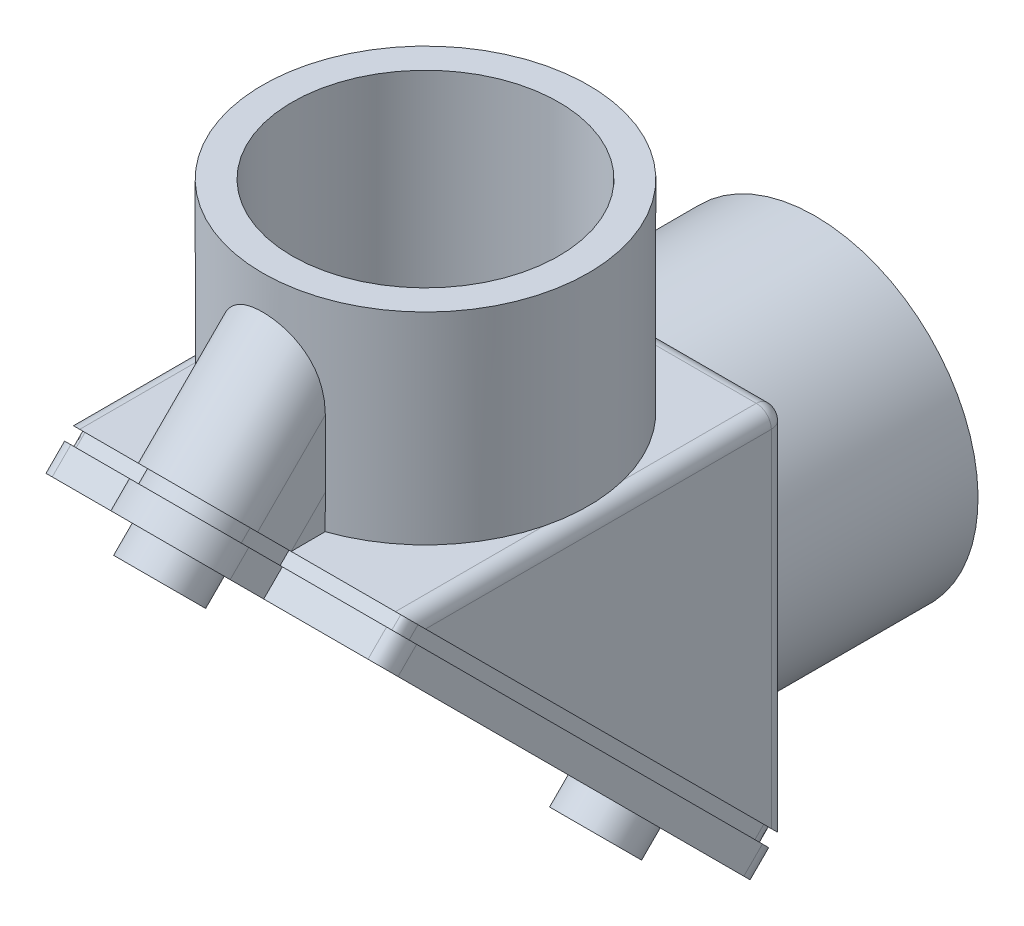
ISO-10303-21;
HEADER;
FILE_DESCRIPTION(('STEP AP214'),'2;1');
FILE_NAME('part.step','',(''),(''),'','','');
FILE_SCHEMA(('AUTOMOTIVE_DESIGN { 1 0 10303 214 1 1 1 1 }'));
ENDSEC;
DATA;
#1=APPLICATION_CONTEXT('core data for automotive mechanical design processes');
#2=APPLICATION_PROTOCOL_DEFINITION('international standard','automotive_design',2000,#1);
#3=PRODUCT_CONTEXT('',#1,'mechanical');
#4=PRODUCT('Part','Part','',(#3));
#5=PRODUCT_RELATED_PRODUCT_CATEGORY('part','',(#4));
#6=PRODUCT_DEFINITION_FORMATION('','',#4);
#7=PRODUCT_DEFINITION_CONTEXT('part definition',#1,'design');
#8=PRODUCT_DEFINITION('design','',#6,#7);
#9=PRODUCT_DEFINITION_SHAPE('','',#8);
#10=(LENGTH_UNIT() NAMED_UNIT(*) SI_UNIT(.MILLI.,.METRE.));
#11=(NAMED_UNIT(*) PLANE_ANGLE_UNIT() SI_UNIT($,.RADIAN.));
#12=(NAMED_UNIT(*) SI_UNIT($,.STERADIAN.) SOLID_ANGLE_UNIT());
#13=UNCERTAINTY_MEASURE_WITH_UNIT(LENGTH_MEASURE(1.E-05),#10,'distance_accuracy_value','');
#14=(GEOMETRIC_REPRESENTATION_CONTEXT(3) GLOBAL_UNCERTAINTY_ASSIGNED_CONTEXT((#13)) GLOBAL_UNIT_ASSIGNED_CONTEXT((#10,
#11,#12)) REPRESENTATION_CONTEXT('',''));
#15=CARTESIAN_POINT('',(0.,0.,0.));
#16=DIRECTION('',(0.,0.,1.));
#17=DIRECTION('',(1.,0.,0.));
#18=AXIS2_PLACEMENT_3D('',#15,#16,#17);
#19=CARTESIAN_POINT('',(-16.002,14.7421206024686,20.3098793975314));
#20=DIRECTION('',(0.,-0.707106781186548,0.707106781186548));
#21=DIRECTION('',(0.,-0.707106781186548,-0.707106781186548));
#22=AXIS2_PLACEMENT_3D('',#19,#20,#21);
#23=PLANE('',#22);
#24=CARTESIAN_POINT('',(0.,-24.692674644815,-19.1249158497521));
#25=DIRECTION('',(0.,-0.707106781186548,0.707106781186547));
#26=DIRECTION('',(0.,-0.707106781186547,-0.707106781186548));
#27=AXIS2_PLACEMENT_3D('',#24,#25,#26);
#28=CIRCLE('',#27,3.81);
#29=CARTESIAN_POINT('',(0.,-27.3867514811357,-21.8189926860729));
#30=VERTEX_POINT('',#29);
#31=EDGE_CURVE('E660',#30,#30,#28,.T.);
#32=ORIENTED_EDGE('',*,*,#31,.F.);
#33=EDGE_LOOP('',(#32));
#34=FACE_BOUND('',#33,.T.);
#35=CARTESIAN_POINT('',(0.,19.6667609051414,25.2345197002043));
#36=DIRECTION('',(0.,-0.707106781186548,0.707106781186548));
#37=DIRECTION('',(0.,-0.707106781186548,-0.707106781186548));
#38=AXIS2_PLACEMENT_3D('',#35,#36,#37);
#39=CIRCLE('',#38,5.4356);
#40=CARTESIAN_POINT('',(5.4356,19.6667609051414,25.2345197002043));
#41=VERTEX_POINT('',#40);
#42=CARTESIAN_POINT('',(-5.4356,19.6667609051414,25.2345197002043));
#43=VERTEX_POINT('',#42);
#44=EDGE_CURVE('E396',#41,#43,#39,.T.);
#45=ORIENTED_EDGE('',*,*,#44,.T.);
#46=DIRECTION('',(0.,-0.707106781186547,-0.707106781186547));
#47=VECTOR('',#46,1.);
#48=CARTESIAN_POINT('',(-5.4356,19.6667609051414,25.2345197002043));
#49=LINE('',#48,#47);
#50=CARTESIAN_POINT('',(-5.4356,16.2661206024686,21.8338793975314));
#51=VERTEX_POINT('',#50);
#52=EDGE_CURVE('E385',#43,#51,#49,.T.);
#53=ORIENTED_EDGE('',*,*,#52,.T.);
#54=DIRECTION('',(-1.,0.,0.));
#55=VECTOR('',#54,1.);
#56=CARTESIAN_POINT('',(-5.4356,16.2661206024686,21.8338793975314));
#57=LINE('',#56,#55);
#58=CARTESIAN_POINT('',(-16.002,16.2661206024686,21.8338793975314));
#59=VERTEX_POINT('',#58);
#60=EDGE_CURVE('E395',#51,#59,#57,.T.);
#61=ORIENTED_EDGE('',*,*,#60,.T.);
#62=CARTESIAN_POINT('',(-16.002,14.7421206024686,20.3098793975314));
#63=DIRECTION('',(0.,-0.707106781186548,0.707106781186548));
#64=DIRECTION('',(0.,-0.707106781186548,-0.707106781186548));
#65=AXIS2_PLACEMENT_3D('',#62,#63,#64);
#66=ELLIPSE('',#65,2.1552614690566,1.524);
#67=CARTESIAN_POINT('',(-17.526,14.7421206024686,20.3098793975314));
#68=VERTEX_POINT('',#67);
#69=EDGE_CURVE('E673',#59,#68,#66,.T.);
#70=ORIENTED_EDGE('',*,*,#69,.T.);
#71=DIRECTION('',(0.,-0.707106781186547,-0.707106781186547));
#72=VECTOR('',#71,1.);
#73=CARTESIAN_POINT('',(-17.526,14.7421206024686,20.3098793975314));
#74=LINE('',#73,#72);
#75=CARTESIAN_POINT('',(-17.526,-20.3098793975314,-14.7421206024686));
#76=VERTEX_POINT('',#75);
#77=EDGE_CURVE('E676',#68,#76,#74,.T.);
#78=ORIENTED_EDGE('',*,*,#77,.T.);
#79=CARTESIAN_POINT('',(-16.002,-20.3098793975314,-14.7421206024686));
#80=DIRECTION('',(0.,-0.707106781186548,0.707106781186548));
#81=DIRECTION('',(0.,-0.707106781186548,-0.707106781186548));
#82=AXIS2_PLACEMENT_3D('',#79,#80,#81);
#83=ELLIPSE('',#82,2.1552614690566,1.524);
#84=CARTESIAN_POINT('',(-16.002,-21.8338793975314,-16.2661206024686));
#85=VERTEX_POINT('',#84);
#86=EDGE_CURVE('E2057',#76,#85,#83,.T.);
#87=ORIENTED_EDGE('',*,*,#86,.T.);
#88=DIRECTION('',(1.,0.,0.));
#89=VECTOR('',#88,1.);
#90=CARTESIAN_POINT('',(-16.002,-21.8338793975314,-16.2661206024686));
#91=LINE('',#90,#89);
#92=CARTESIAN_POINT('',(-5.4356,-21.8338793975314,-16.2661206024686));
#93=VERTEX_POINT('',#92);
#94=EDGE_CURVE('E2059',#85,#93,#91,.T.);
#95=ORIENTED_EDGE('',*,*,#94,.T.);
#96=DIRECTION('',(0.,-0.707106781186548,-0.707106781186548));
#97=VECTOR('',#96,1.);
#98=CARTESIAN_POINT('',(-5.4356,-21.8338793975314,-16.2661206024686));
#99=LINE('',#98,#97);
#100=CARTESIAN_POINT('',(-5.4356,-25.2345197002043,-19.6667609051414));
#101=VERTEX_POINT('',#100);
#102=EDGE_CURVE('E2060',#93,#101,#99,.T.);
#103=ORIENTED_EDGE('',*,*,#102,.T.);
#104=CARTESIAN_POINT('',(0.,-25.2345197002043,-19.6667609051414));
#105=DIRECTION('',(0.,-0.707106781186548,0.707106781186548));
#106=DIRECTION('',(0.,-0.707106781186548,-0.707106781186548));
#107=AXIS2_PLACEMENT_3D('',#104,#105,#106);
#108=CIRCLE('',#107,5.4356);
#109=CARTESIAN_POINT('',(5.4356,-25.2345197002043,-19.6667609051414));
#110=VERTEX_POINT('',#109);
#111=EDGE_CURVE('E2096',#101,#110,#108,.T.);
#112=ORIENTED_EDGE('',*,*,#111,.T.);
#113=DIRECTION('',(0.,0.707106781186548,0.707106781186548));
#114=VECTOR('',#113,1.);
#115=CARTESIAN_POINT('',(5.4356,-25.2345197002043,-19.6667609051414));
#116=LINE('',#115,#114);
#117=CARTESIAN_POINT('',(5.4356,-21.8338793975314,-16.2661206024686));
#118=VERTEX_POINT('',#117);
#119=EDGE_CURVE('E2093',#110,#118,#116,.T.);
#120=ORIENTED_EDGE('',*,*,#119,.T.);
#121=DIRECTION('',(1.,0.,0.));
#122=VECTOR('',#121,1.);
#123=CARTESIAN_POINT('',(5.4356,-21.8338793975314,-16.2661206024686));
#124=LINE('',#123,#122);
#125=CARTESIAN_POINT('',(16.002,-21.8338793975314,-16.2661206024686));
#126=VERTEX_POINT('',#125);
#127=EDGE_CURVE('E2070',#118,#126,#124,.T.);
#128=ORIENTED_EDGE('',*,*,#127,.T.);
#129=CARTESIAN_POINT('',(16.002,-20.3098793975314,-14.7421206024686));
#130=DIRECTION('',(0.,-0.707106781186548,0.707106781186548));
#131=DIRECTION('',(0.,0.707106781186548,0.707106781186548));
#132=AXIS2_PLACEMENT_3D('',#129,#130,#131);
#133=ELLIPSE('',#132,2.1552614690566,1.524);
#134=CARTESIAN_POINT('',(17.526,-20.3098793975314,-14.7421206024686));
#135=VERTEX_POINT('',#134);
#136=EDGE_CURVE('E2065',#126,#135,#133,.T.);
#137=ORIENTED_EDGE('',*,*,#136,.T.);
#138=DIRECTION('',(0.,0.707106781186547,0.707106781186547));
#139=VECTOR('',#138,1.);
#140=CARTESIAN_POINT('',(17.526,-20.3098793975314,-14.7421206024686));
#141=LINE('',#140,#139);
#142=CARTESIAN_POINT('',(17.526,14.7421206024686,20.3098793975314));
#143=VERTEX_POINT('',#142);
#144=EDGE_CURVE('E2069',#135,#143,#141,.T.);
#145=ORIENTED_EDGE('',*,*,#144,.T.);
#146=CARTESIAN_POINT('',(16.002,14.7421206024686,20.3098793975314));
#147=DIRECTION('',(0.,-0.707106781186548,0.707106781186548));
#148=DIRECTION('',(0.,0.707106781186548,0.707106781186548));
#149=AXIS2_PLACEMENT_3D('',#146,#147,#148);
#150=ELLIPSE('',#149,2.1552614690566,1.524);
#151=CARTESIAN_POINT('',(16.002,16.2661206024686,21.8338793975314));
#152=VERTEX_POINT('',#151);
#153=EDGE_CURVE('E2073',#143,#152,#150,.T.);
#154=ORIENTED_EDGE('',*,*,#153,.T.);
#155=DIRECTION('',(-1.,0.,0.));
#156=VECTOR('',#155,1.);
#157=CARTESIAN_POINT('',(16.002,16.2661206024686,21.8338793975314));
#158=LINE('',#157,#156);
#159=CARTESIAN_POINT('',(5.4356,16.2661206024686,21.8338793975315));
#160=VERTEX_POINT('',#159);
#161=EDGE_CURVE('E2075',#152,#160,#158,.T.);
#162=ORIENTED_EDGE('',*,*,#161,.T.);
#163=DIRECTION('',(0.,0.707106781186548,0.707106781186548));
#164=VECTOR('',#163,1.);
#165=CARTESIAN_POINT('',(5.4356,16.2661206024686,21.8338793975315));
#166=LINE('',#165,#164);
#167=EDGE_CURVE('E401',#160,#41,#166,.T.);
#168=ORIENTED_EDGE('',*,*,#167,.T.);
#169=EDGE_LOOP('',(#45,#53,#61,#70,#78,#87,#95,#103,#112,#120,#128,#137,#145,#154,#162,#168));
#170=FACE_BOUND('',#169,.T.);
#171=CARTESIAN_POINT('',(0.,19.4939359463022,25.0616947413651));
#172=DIRECTION('',(0.,-0.707106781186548,0.707106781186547));
#173=DIRECTION('',(0.,-0.707106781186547,-0.707106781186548));
#174=AXIS2_PLACEMENT_3D('',#171,#172,#173);
#175=CIRCLE('',#174,3.81);
#176=CARTESIAN_POINT('',(0.,16.7998591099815,22.3676179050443));
#177=VERTEX_POINT('',#176);
#178=EDGE_CURVE('E668',#177,#177,#175,.T.);
#179=ORIENTED_EDGE('',*,*,#178,.F.);
#180=EDGE_LOOP('',(#179));
#181=FACE_BOUND('',#180,.T.);
#182=ADVANCED_FACE('F36',(#34,#170,#181),#23,.T.);
#183=CARTESIAN_POINT('',(17.526,19.05,19.05));
#184=DIRECTION('',(0.,0.707106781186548,-0.707106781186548));
#185=DIRECTION('',(0.,0.707106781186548,0.707106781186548));
#186=AXIS2_PLACEMENT_3D('',#183,#184,#185);
#187=PLANE('',#186);
#188=DIRECTION('',(0.,-0.707106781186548,-0.707106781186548));
#189=VECTOR('',#188,1.);
#190=CARTESIAN_POINT('',(-5.4356,19.05,19.05));
#191=LINE('',#190,#189);
#192=CARTESIAN_POINT('',(-5.4356,22.4506403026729,22.4506403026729));
#193=VERTEX_POINT('',#192);
#194=CARTESIAN_POINT('',(-5.4356,19.05,19.05));
#195=VERTEX_POINT('',#194);
#196=EDGE_CURVE('E1554',#193,#195,#191,.T.);
#197=ORIENTED_EDGE('',*,*,#196,.T.);
#198=DIRECTION('',(-1.,0.,0.));
#199=VECTOR('',#198,1.);
#200=CARTESIAN_POINT('',(17.526,19.05,19.05));
#201=LINE('',#200,#199);
#202=CARTESIAN_POINT('',(-16.002,19.05,19.05));
#203=VERTEX_POINT('',#202);
#204=EDGE_CURVE('E1604',#195,#203,#201,.T.);
#205=ORIENTED_EDGE('',*,*,#204,.T.);
#206=CARTESIAN_POINT('',(-16.002,17.526,17.526));
#207=DIRECTION('',(0.,0.707106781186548,-0.707106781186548));
#208=DIRECTION('',(0.,-0.707106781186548,-0.707106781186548));
#209=AXIS2_PLACEMENT_3D('',#206,#207,#208);
#210=ELLIPSE('',#209,2.1552614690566,1.524);
#211=CARTESIAN_POINT('',(-17.526,17.526,17.526));
#212=VERTEX_POINT('',#211);
#213=EDGE_CURVE('E1626',#203,#212,#210,.F.);
#214=ORIENTED_EDGE('',*,*,#213,.T.);
#215=DIRECTION('',(0.,-0.707106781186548,-0.707106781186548));
#216=VECTOR('',#215,1.);
#217=CARTESIAN_POINT('',(-17.526,19.05,19.05));
#218=LINE('',#217,#216);
#219=CARTESIAN_POINT('',(-17.526,-17.526,-17.526));
#220=VERTEX_POINT('',#219);
#221=EDGE_CURVE('E1596',#212,#220,#218,.T.);
#222=ORIENTED_EDGE('',*,*,#221,.T.);
#223=CARTESIAN_POINT('',(-16.002,-17.526,-17.526));
#224=DIRECTION('',(0.,0.707106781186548,-0.707106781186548));
#225=DIRECTION('',(0.,-0.707106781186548,-0.707106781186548));
#226=AXIS2_PLACEMENT_3D('',#223,#224,#225);
#227=ELLIPSE('',#226,2.1552614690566,1.524);
#228=CARTESIAN_POINT('',(-16.002,-19.05,-19.05));
#229=VERTEX_POINT('',#228);
#230=EDGE_CURVE('E1628',#220,#229,#227,.F.);
#231=ORIENTED_EDGE('',*,*,#230,.T.);
#232=DIRECTION('',(-1.,0.,0.));
#233=VECTOR('',#232,1.);
#234=CARTESIAN_POINT('',(17.526,-19.05,-19.05));
#235=LINE('',#234,#233);
#236=CARTESIAN_POINT('',(-5.4356,-19.05,-19.05));
#237=VERTEX_POINT('',#236);
#238=EDGE_CURVE('E1602',#237,#229,#235,.T.);
#239=ORIENTED_EDGE('',*,*,#238,.F.);
#240=DIRECTION('',(0.,-0.707106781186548,-0.707106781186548));
#241=VECTOR('',#240,1.);
#242=CARTESIAN_POINT('',(-5.4356,-22.4506403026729,-22.4506403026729));
#243=LINE('',#242,#241);
#244=CARTESIAN_POINT('',(-5.4356,-22.4506403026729,-22.4506403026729));
#245=VERTEX_POINT('',#244);
#246=EDGE_CURVE('E1562',#237,#245,#243,.T.);
#247=ORIENTED_EDGE('',*,*,#246,.T.);
#248=CARTESIAN_POINT('',(0.,-22.4506403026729,-22.4506403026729));
#249=DIRECTION('',(0.,-0.707106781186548,0.707106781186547));
#250=DIRECTION('',(0.,-0.707106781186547,-0.707106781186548));
#251=AXIS2_PLACEMENT_3D('',#248,#249,#250);
#252=CIRCLE('',#251,5.4356);
#253=CARTESIAN_POINT('',(5.4356,-22.4506403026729,-22.4506403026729));
#254=VERTEX_POINT('',#253);
#255=EDGE_CURVE('E1552',#245,#254,#252,.T.);
#256=ORIENTED_EDGE('',*,*,#255,.T.);
#257=DIRECTION('',(0.,0.707106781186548,0.707106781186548));
#258=VECTOR('',#257,1.);
#259=CARTESIAN_POINT('',(5.4356,-22.4506403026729,-22.4506403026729));
#260=LINE('',#259,#258);
#261=CARTESIAN_POINT('',(5.4356,-19.05,-19.05));
#262=VERTEX_POINT('',#261);
#263=EDGE_CURVE('E1560',#254,#262,#260,.T.);
#264=ORIENTED_EDGE('',*,*,#263,.T.);
#265=CARTESIAN_POINT('',(16.002,-19.05,-19.05));
#266=VERTEX_POINT('',#265);
#267=EDGE_CURVE('E1521',#266,#262,#235,.T.);
#268=ORIENTED_EDGE('',*,*,#267,.F.);
#269=CARTESIAN_POINT('',(16.002,-17.526,-17.526));
#270=DIRECTION('',(0.,0.707106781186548,-0.707106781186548));
#271=DIRECTION('',(0.,0.707106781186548,0.707106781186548));
#272=AXIS2_PLACEMENT_3D('',#269,#270,#271);
#273=ELLIPSE('',#272,2.1552614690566,1.524);
#274=CARTESIAN_POINT('',(17.526,-17.526,-17.526));
#275=VERTEX_POINT('',#274);
#276=EDGE_CURVE('E1624',#266,#275,#273,.F.);
#277=ORIENTED_EDGE('',*,*,#276,.T.);
#278=DIRECTION('',(0.,-0.707106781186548,-0.707106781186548));
#279=VECTOR('',#278,1.);
#280=CARTESIAN_POINT('',(17.526,19.05,19.05));
#281=LINE('',#280,#279);
#282=CARTESIAN_POINT('',(17.526,17.526,17.526));
#283=VERTEX_POINT('',#282);
#284=EDGE_CURVE('E1599',#283,#275,#281,.T.);
#285=ORIENTED_EDGE('',*,*,#284,.F.);
#286=CARTESIAN_POINT('',(16.002,17.526,17.526));
#287=DIRECTION('',(0.,0.707106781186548,-0.707106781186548));
#288=DIRECTION('',(0.,0.707106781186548,0.707106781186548));
#289=AXIS2_PLACEMENT_3D('',#286,#287,#288);
#290=ELLIPSE('',#289,2.1552614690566,1.524);
#291=CARTESIAN_POINT('',(16.002,19.05,19.05));
#292=VERTEX_POINT('',#291);
#293=EDGE_CURVE('E1622',#283,#292,#290,.F.);
#294=ORIENTED_EDGE('',*,*,#293,.T.);
#295=CARTESIAN_POINT('',(5.4356,19.05,19.05));
#296=VERTEX_POINT('',#295);
#297=EDGE_CURVE('E1605',#292,#296,#201,.T.);
#298=ORIENTED_EDGE('',*,*,#297,.T.);
#299=DIRECTION('',(0.,0.707106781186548,0.707106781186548));
#300=VECTOR('',#299,1.);
#301=CARTESIAN_POINT('',(5.4356,22.4506403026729,22.4506403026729));
#302=LINE('',#301,#300);
#303=CARTESIAN_POINT('',(5.4356,22.4506403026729,22.4506403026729));
#304=VERTEX_POINT('',#303);
#305=EDGE_CURVE('E1685',#296,#304,#302,.T.);
#306=ORIENTED_EDGE('',*,*,#305,.T.);
#307=CARTESIAN_POINT('',(0.,22.4506403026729,22.4506403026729));
#308=DIRECTION('',(0.,-0.707106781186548,0.707106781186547));
#309=DIRECTION('',(0.,0.707106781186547,0.707106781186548));
#310=AXIS2_PLACEMENT_3D('',#307,#308,#309);
#311=CIRCLE('',#310,5.4356);
#312=EDGE_CURVE('E1548',#304,#193,#311,.T.);
#313=ORIENTED_EDGE('',*,*,#312,.T.);
#314=EDGE_LOOP('',(#197,#205,#214,#222,#231,#239,#247,#256,#264,#268,#277,#285,#294,#298,#306,#313));
#315=FACE_BOUND('',#314,.T.);
#316=CARTESIAN_POINT('',(0.,22.4506403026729,22.4506403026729));
#317=DIRECTION('',(0.,-0.707106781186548,0.707106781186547));
#318=DIRECTION('',(0.,-0.707106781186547,-0.707106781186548));
#319=AXIS2_PLACEMENT_3D('',#316,#317,#318);
#320=CIRCLE('',#319,4.6736);
#321=CARTESIAN_POINT('',(4.6736,22.4506403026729,22.4506403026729));
#322=VERTEX_POINT('',#321);
#323=CARTESIAN_POINT('',(-4.6736,22.4506403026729,22.4506403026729));
#324=VERTEX_POINT('',#323);
#325=EDGE_CURVE('E410',#322,#324,#320,.T.);
#326=ORIENTED_EDGE('',*,*,#325,.F.);
#327=DIRECTION('',(0.,0.707106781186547,0.707106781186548));
#328=VECTOR('',#327,1.);
#329=CARTESIAN_POINT('',(4.6736,18.5111846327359,18.5111846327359));
#330=LINE('',#329,#328);
#331=CARTESIAN_POINT('',(4.6736,18.5111846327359,18.5111846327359));
#332=VERTEX_POINT('',#331);
#333=EDGE_CURVE('E480',#332,#322,#330,.T.);
#334=ORIENTED_EDGE('',*,*,#333,.F.);
#335=DIRECTION('',(-1.,0.,0.));
#336=VECTOR('',#335,1.);
#337=CARTESIAN_POINT('',(16.002,18.5111846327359,18.5111846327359));
#338=LINE('',#337,#336);
#339=CARTESIAN_POINT('',(16.002,18.5111846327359,18.5111846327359));
#340=VERTEX_POINT('',#339);
#341=EDGE_CURVE('E748',#340,#332,#338,.T.);
#342=ORIENTED_EDGE('',*,*,#341,.F.);
#343=CARTESIAN_POINT('',(16.764,17.526,17.526));
#344=CARTESIAN_POINT('',(16.764,17.6273976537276,17.6273976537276));
#345=CARTESIAN_POINT('',(16.7507870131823,17.7271843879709,17.7271843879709));
#346=CARTESIAN_POINT('',(16.6971924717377,17.9234454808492,17.9234454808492));
#347=CARTESIAN_POINT('',(16.6563443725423,18.0210310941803,18.0210310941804));
#348=CARTESIAN_POINT('',(16.5412831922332,18.2061952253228,18.2061952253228));
#349=CARTESIAN_POINT('',(16.4670435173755,18.2947640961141,18.2947640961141));
#350=CARTESIAN_POINT('',(16.3221865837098,18.4062829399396,18.4062829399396));
#351=CARTESIAN_POINT('',(16.2674750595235,18.4403960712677,18.4403960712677));
#352=CARTESIAN_POINT('',(16.1445082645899,18.4927628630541,18.4927628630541));
#353=CARTESIAN_POINT('',(16.0747345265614,18.5111846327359,18.5111846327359));
#354=CARTESIAN_POINT('',(16.002,18.5111846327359,18.5111846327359));
#355=B_SPLINE_CURVE_WITH_KNOTS('',3,(#343,#344,#345,#346,#347,#348,#349,#350,#351,#352,#353,
#354),.UNSPECIFIED.,.F.,.F.,(4,2,2,2,2,4),(0.,0.249999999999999,0.499999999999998,
0.749999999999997,0.874999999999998,1.),.UNSPECIFIED.);
#356=CARTESIAN_POINT('',(16.764,17.526,17.526));
#357=VERTEX_POINT('',#356);
#358=EDGE_CURVE('E802',#357,#340,#355,.T.);
#359=ORIENTED_EDGE('',*,*,#358,.F.);
#360=DIRECTION('',(0.,0.707106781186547,0.707106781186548));
#361=VECTOR('',#360,1.);
#362=CARTESIAN_POINT('',(16.764,-17.526,-17.526));
#363=LINE('',#362,#361);
#364=CARTESIAN_POINT('',(16.764,-17.526,-17.526));
#365=VERTEX_POINT('',#364);
#366=EDGE_CURVE('E806',#365,#357,#363,.T.);
#367=ORIENTED_EDGE('',*,*,#366,.F.);
#368=CARTESIAN_POINT('',(16.002,-18.5111846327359,-18.5111846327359));
#369=CARTESIAN_POINT('',(16.0748741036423,-18.5111846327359,-18.5111846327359));
#370=CARTESIAN_POINT('',(16.1443295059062,-18.4928009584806,-18.4928009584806));
#371=CARTESIAN_POINT('',(16.2670237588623,-18.4406260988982,-18.4406260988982));
#372=CARTESIAN_POINT('',(16.3218518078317,-18.4065001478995,-18.4065001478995));
#373=CARTESIAN_POINT('',(16.4666470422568,-18.2951499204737,-18.2951499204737));
#374=CARTESIAN_POINT('',(16.5409276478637,-18.2065250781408,-18.2065250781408));
#375=CARTESIAN_POINT('',(16.6554006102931,-18.0227894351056,-18.0227894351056));
#376=CARTESIAN_POINT('',(16.6967342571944,-17.9248329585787,-17.9248329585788));
#377=CARTESIAN_POINT('',(16.7508043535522,-17.727409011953,-17.727409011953));
#378=CARTESIAN_POINT('',(16.764,-17.6273477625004,-17.6273477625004));
#379=CARTESIAN_POINT('',(16.764,-17.526,-17.526));
#380=B_SPLINE_CURVE_WITH_KNOTS('',3,(#368,#369,#370,#371,#372,#373,#374,#375,#376,#377,#378,
#379),.UNSPECIFIED.,.F.,.F.,(4,2,2,2,2,4),(0.,0.125000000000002,0.250000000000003,
0.500000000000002,0.750000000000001,1.),.UNSPECIFIED.);
#381=CARTESIAN_POINT('',(16.002,-18.5111846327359,-18.5111846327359));
#382=VERTEX_POINT('',#381);
#383=EDGE_CURVE('E814',#382,#365,#380,.T.);
#384=ORIENTED_EDGE('',*,*,#383,.F.);
#385=DIRECTION('',(1.,0.,0.));
#386=VECTOR('',#385,1.);
#387=CARTESIAN_POINT('',(4.6736,-18.5111846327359,-18.5111846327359));
#388=LINE('',#387,#386);
#389=CARTESIAN_POINT('',(4.6736,-18.5111846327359,-18.5111846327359));
#390=VERTEX_POINT('',#389);
#391=EDGE_CURVE('E745',#390,#382,#388,.T.);
#392=ORIENTED_EDGE('',*,*,#391,.F.);
#393=DIRECTION('',(0.,0.707106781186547,0.707106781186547));
#394=VECTOR('',#393,1.);
#395=CARTESIAN_POINT('',(4.6736,-22.4506403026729,-22.4506403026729));
#396=LINE('',#395,#394);
#397=CARTESIAN_POINT('',(4.6736,-22.4506403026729,-22.4506403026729));
#398=VERTEX_POINT('',#397);
#399=EDGE_CURVE('E742',#398,#390,#396,.T.);
#400=ORIENTED_EDGE('',*,*,#399,.F.);
#401=CARTESIAN_POINT('',(0.,-22.4506403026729,-22.4506403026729));
#402=DIRECTION('',(0.,-0.707106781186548,0.707106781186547));
#403=DIRECTION('',(0.,-0.707106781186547,-0.707106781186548));
#404=AXIS2_PLACEMENT_3D('',#401,#402,#403);
#405=CIRCLE('',#404,4.6736);
#406=CARTESIAN_POINT('',(-4.6736,-22.4506403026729,-22.4506403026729));
#407=VERTEX_POINT('',#406);
#408=EDGE_CURVE('E738',#407,#398,#405,.T.);
#409=ORIENTED_EDGE('',*,*,#408,.F.);
#410=DIRECTION('',(0.,-0.707106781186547,-0.707106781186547));
#411=VECTOR('',#410,1.);
#412=CARTESIAN_POINT('',(-4.6736,-18.5111846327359,-18.5111846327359));
#413=LINE('',#412,#411);
#414=CARTESIAN_POINT('',(-4.6736,-18.5111846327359,-18.5111846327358));
#415=VERTEX_POINT('',#414);
#416=EDGE_CURVE('E735',#415,#407,#413,.T.);
#417=ORIENTED_EDGE('',*,*,#416,.F.);
#418=DIRECTION('',(1.,0.,0.));
#419=VECTOR('',#418,1.);
#420=CARTESIAN_POINT('',(-16.002,-18.5111846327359,-18.5111846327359));
#421=LINE('',#420,#419);
#422=CARTESIAN_POINT('',(-16.002,-18.5111846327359,-18.5111846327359));
#423=VERTEX_POINT('',#422);
#424=EDGE_CURVE('E739',#423,#415,#421,.T.);
#425=ORIENTED_EDGE('',*,*,#424,.F.);
#426=CARTESIAN_POINT('',(-16.764,-17.526,-17.526));
#427=CARTESIAN_POINT('',(-16.764,-17.6273976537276,-17.6273976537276));
#428=CARTESIAN_POINT('',(-16.7507870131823,-17.7271843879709,-17.7271843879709));
#429=CARTESIAN_POINT('',(-16.6971924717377,-17.9234454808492,-17.9234454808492));
#430=CARTESIAN_POINT('',(-16.6563443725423,-18.0210310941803,-18.0210310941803));
#431=CARTESIAN_POINT('',(-16.5412831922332,-18.2061952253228,-18.2061952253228));
#432=CARTESIAN_POINT('',(-16.4670435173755,-18.2947640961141,-18.2947640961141));
#433=CARTESIAN_POINT('',(-16.3221865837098,-18.4062829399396,-18.4062829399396));
#434=CARTESIAN_POINT('',(-16.2674750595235,-18.4403960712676,-18.4403960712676));
#435=CARTESIAN_POINT('',(-16.1445082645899,-18.4927628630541,-18.4927628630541));
#436=CARTESIAN_POINT('',(-16.0747345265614,-18.5111846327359,-18.5111846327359));
#437=CARTESIAN_POINT('',(-16.002,-18.5111846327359,-18.5111846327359));
#438=B_SPLINE_CURVE_WITH_KNOTS('',3,(#426,#427,#428,#429,#430,#431,#432,#433,#434,#435,#436,
#437),.UNSPECIFIED.,.F.,.F.,(4,2,2,2,2,4),(0.,0.249999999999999,0.499999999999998,
0.749999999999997,0.874999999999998,1.),.UNSPECIFIED.);
#439=CARTESIAN_POINT('',(-16.764,-17.526,-17.526));
#440=VERTEX_POINT('',#439);
#441=EDGE_CURVE('E896',#440,#423,#438,.T.);
#442=ORIENTED_EDGE('',*,*,#441,.F.);
#443=DIRECTION('',(0.,-0.707106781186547,-0.707106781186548));
#444=VECTOR('',#443,1.);
#445=CARTESIAN_POINT('',(-16.764,17.526,17.526));
#446=LINE('',#445,#444);
#447=CARTESIAN_POINT('',(-16.764,17.526,17.526));
#448=VERTEX_POINT('',#447);
#449=EDGE_CURVE('E888',#448,#440,#446,.T.);
#450=ORIENTED_EDGE('',*,*,#449,.F.);
#451=CARTESIAN_POINT('',(-16.002,18.5111846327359,18.5111846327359));
#452=CARTESIAN_POINT('',(-16.0748741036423,18.5111846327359,18.5111846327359));
#453=CARTESIAN_POINT('',(-16.1443295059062,18.4928009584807,18.4928009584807));
#454=CARTESIAN_POINT('',(-16.2670237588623,18.4406260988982,18.4406260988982));
#455=CARTESIAN_POINT('',(-16.3218518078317,18.4065001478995,18.4065001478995));
#456=CARTESIAN_POINT('',(-16.4666470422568,18.2951499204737,18.2951499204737));
#457=CARTESIAN_POINT('',(-16.5409276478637,18.2065250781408,18.2065250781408));
#458=CARTESIAN_POINT('',(-16.6554006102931,18.0227894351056,18.0227894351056));
#459=CARTESIAN_POINT('',(-16.6967342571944,17.9248329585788,17.9248329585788));
#460=CARTESIAN_POINT('',(-16.7508043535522,17.727409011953,17.727409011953));
#461=CARTESIAN_POINT('',(-16.764,17.6273477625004,17.6273477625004));
#462=CARTESIAN_POINT('',(-16.764,17.526,17.526));
#463=B_SPLINE_CURVE_WITH_KNOTS('',3,(#451,#452,#453,#454,#455,#456,#457,#458,#459,#460,#461,
#462),.UNSPECIFIED.,.F.,.F.,(4,2,2,2,2,4),(0.,0.125000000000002,0.250000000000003,
0.500000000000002,0.750000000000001,1.),.UNSPECIFIED.);
#464=CARTESIAN_POINT('',(-16.002,18.5111846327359,18.5111846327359));
#465=VERTEX_POINT('',#464);
#466=EDGE_CURVE('E525',#465,#448,#463,.T.);
#467=ORIENTED_EDGE('',*,*,#466,.F.);
#468=DIRECTION('',(-1.,0.,0.));
#469=VECTOR('',#468,1.);
#470=CARTESIAN_POINT('',(-4.6736,18.5111846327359,18.5111846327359));
#471=LINE('',#470,#469);
#472=CARTESIAN_POINT('',(-4.6736,18.5111846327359,18.5111846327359));
#473=VERTEX_POINT('',#472);
#474=EDGE_CURVE('E60',#473,#465,#471,.T.);
#475=ORIENTED_EDGE('',*,*,#474,.F.);
#476=DIRECTION('',(0.,-0.707106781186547,-0.707106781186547));
#477=VECTOR('',#476,1.);
#478=CARTESIAN_POINT('',(-4.6736,22.4506403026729,22.4506403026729));
#479=LINE('',#478,#477);
#480=EDGE_CURVE('E55',#324,#473,#479,.T.);
#481=ORIENTED_EDGE('',*,*,#480,.F.);
#482=EDGE_LOOP('',(#326,#334,#342,#359,#367,#384,#392,#400,#409,#417,#425,#442,#450,#467,#475,#481));
#483=FACE_BOUND('',#482,.T.);
#484=ADVANCED_FACE('F651',(#315,#483),#187,.F.);
#485=CARTESIAN_POINT('',(17.526,0.,-19.05));
#486=DIRECTION('',(0.,0.,1.));
#487=DIRECTION('',(0.,-1.,0.));
#488=AXIS2_PLACEMENT_3D('',#485,#486,#487);
#489=PLANE('',#488);
#490=CARTESIAN_POINT('',(0.,0.,-19.05));
#491=DIRECTION('',(0.,0.,-1.));
#492=DIRECTION('',(0.,1.,0.));
#493=AXIS2_PLACEMENT_3D('',#490,#491,#492);
#494=CIRCLE('',#493,16.51);
#495=CARTESIAN_POINT('',(-5.4356,-15.5895590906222,-19.05));
#496=VERTEX_POINT('',#495);
#497=CARTESIAN_POINT('',(-16.002,-4.06400000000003,-19.05));
#498=VERTEX_POINT('',#497);
#499=EDGE_CURVE('E1752',#496,#498,#494,.T.);
#500=ORIENTED_EDGE('',*,*,#499,.F.);
#501=DIRECTION('',(0.,-1.,0.));
#502=VECTOR('',#501,1.);
#503=CARTESIAN_POINT('',(-5.4356,0.,-19.05));
#504=LINE('',#503,#502);
#505=EDGE_CURVE('E1522',#496,#237,#504,.T.);
#506=ORIENTED_EDGE('',*,*,#505,.T.);
#507=ORIENTED_EDGE('',*,*,#238,.T.);
#508=DIRECTION('',(0.,1.,0.));
#509=VECTOR('',#508,1.);
#510=CARTESIAN_POINT('',(-16.002,19.05,-19.05));
#511=LINE('',#510,#509);
#512=EDGE_CURVE('E1615',#229,#498,#511,.T.);
#513=ORIENTED_EDGE('',*,*,#512,.T.);
#514=EDGE_LOOP('',(#500,#506,#507,#513));
#515=FACE_BOUND('',#514,.T.);
#516=ADVANCED_FACE('F656',(#515),#489,.F.);
#517=CARTESIAN_POINT('',(-16.002,4.06400000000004,-19.05));
#518=VERTEX_POINT('',#517);
#519=CARTESIAN_POINT('',(16.002,4.06400000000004,-19.05));
#520=VERTEX_POINT('',#519);
#521=EDGE_CURVE('E551',#518,#520,#494,.T.);
#522=ORIENTED_EDGE('',*,*,#521,.F.);
#523=CARTESIAN_POINT('',(-16.002,17.526,-19.05));
#524=VERTEX_POINT('',#523);
#525=EDGE_CURVE('E1614',#518,#524,#511,.T.);
#526=ORIENTED_EDGE('',*,*,#525,.T.);
#527=DIRECTION('',(-1.,0.,0.));
#528=VECTOR('',#527,1.);
#529=CARTESIAN_POINT('',(17.526,17.526,-19.05));
#530=LINE('',#529,#528);
#531=CARTESIAN_POINT('',(16.002,17.526,-19.05));
#532=VERTEX_POINT('',#531);
#533=EDGE_CURVE('E1612',#524,#532,#530,.F.);
#534=ORIENTED_EDGE('',*,*,#533,.T.);
#535=DIRECTION('',(0.,1.,0.));
#536=VECTOR('',#535,1.);
#537=CARTESIAN_POINT('',(16.002,0.,-19.05));
#538=LINE('',#537,#536);
#539=EDGE_CURVE('E1609',#532,#520,#538,.F.);
#540=ORIENTED_EDGE('',*,*,#539,.T.);
#541=EDGE_LOOP('',(#522,#526,#534,#540));
#542=FACE_BOUND('',#541,.T.);
#543=ADVANCED_FACE('F1715',(#542),#489,.F.);
#544=CARTESIAN_POINT('',(16.002,-4.06400000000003,-19.05));
#545=VERTEX_POINT('',#544);
#546=CARTESIAN_POINT('',(5.42419755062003,-15.5935300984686,-19.05));
#547=VERTEX_POINT('',#546);
#548=EDGE_CURVE('E561',#545,#547,#494,.T.);
#549=ORIENTED_EDGE('',*,*,#548,.F.);
#550=EDGE_CURVE('E1608',#545,#266,#538,.F.);
#551=ORIENTED_EDGE('',*,*,#550,.T.);
#552=ORIENTED_EDGE('',*,*,#267,.T.);
#553=DIRECTION('',(-0.00329885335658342,0.999994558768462,0.));
#554=VECTOR('',#553,1.);
#555=CARTESIAN_POINT('',(5.37288875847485,-0.0400915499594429,-19.05));
#556=LINE('',#555,#554);
#557=EDGE_CURVE('E1513',#262,#547,#556,.T.);
#558=ORIENTED_EDGE('',*,*,#557,.T.);
#559=EDGE_LOOP('',(#549,#551,#552,#558));
#560=FACE_BOUND('',#559,.T.);
#561=ADVANCED_FACE('F632',(#560),#489,.F.);
#562=CARTESIAN_POINT('',(-5.4356,-10.0578868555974,-34.8433937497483));
#563=DIRECTION('',(-1.,0.,0.));
#564=DIRECTION('',(0.,0.,1.));
#565=AXIS2_PLACEMENT_3D('',#562,#563,#564);
#566=PLANE('',#565);
#567=ORIENTED_EDGE('',*,*,#505,.F.);
#568=DIRECTION('',(0.,0.,1.));
#569=VECTOR('',#568,1.);
#570=CARTESIAN_POINT('',(-5.4356,-15.5895590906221,-39.497));
#571=LINE('',#570,#569);
#572=CARTESIAN_POINT('',(-5.4356,-15.5895590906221,-29.3117215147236));
#573=VERTEX_POINT('',#572);
#574=EDGE_CURVE('E1505',#496,#573,#571,.F.);
#575=ORIENTED_EDGE('',*,*,#574,.T.);
#576=DIRECTION('',(0.,-0.707106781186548,0.707106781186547));
#577=VECTOR('',#576,1.);
#578=CARTESIAN_POINT('',(-5.4356,-10.0578868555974,-34.8433937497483));
#579=LINE('',#578,#577);
#580=EDGE_CURVE('E1566',#573,#245,#579,.T.);
#581=ORIENTED_EDGE('',*,*,#580,.T.);
#582=ORIENTED_EDGE('',*,*,#246,.F.);
#583=EDGE_LOOP('',(#567,#575,#581,#582));
#584=FACE_BOUND('',#583,.T.);
#585=ADVANCED_FACE('F628',(#584),#566,.T.);
#586=CARTESIAN_POINT('',(5.4158758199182,-3.66771191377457,-28.4532188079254));
#587=DIRECTION('',(0.999989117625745,0.00329883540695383,0.00329883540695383));
#588=DIRECTION('',(0.00329885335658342,0.,-0.999994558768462));
#589=AXIS2_PLACEMENT_3D('',#586,#587,#588);
#590=PLANE('',#589);
#591=DIRECTION('',(0.,-0.707106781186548,0.707106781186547));
#592=VECTOR('',#591,1.);
#593=CARTESIAN_POINT('',(5.4356,-6.65724655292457,-31.4427534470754));
#594=LINE('',#593,#592);
#595=CARTESIAN_POINT('',(5.4356,-15.5895590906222,-22.5104409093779));
#596=VERTEX_POINT('',#595);
#597=EDGE_CURVE('E1515',#596,#262,#594,.T.);
#598=ORIENTED_EDGE('',*,*,#597,.F.);
#599=CARTESIAN_POINT('',(0.,-5.86296497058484E-13,1609.61508039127));
#600=DIRECTION('',(0.999989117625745,0.00329883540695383,0.00329883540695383));
#601=DIRECTION('',(-0.00329881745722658,-1.08823742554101E-05,0.999994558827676));
#602=AXIS2_PLACEMENT_3D('',#599,#600,#601);
#603=ELLIPSE('',#602,5004.79653067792,16.51);
#604=EDGE_CURVE('E569',#596,#547,#603,.F.);
#605=ORIENTED_EDGE('',*,*,#604,.T.);
#606=ORIENTED_EDGE('',*,*,#557,.F.);
#607=EDGE_LOOP('',(#598,#605,#606));
#608=FACE_BOUND('',#607,.T.);
#609=ADVANCED_FACE('F631',(#608),#590,.T.);
#610=CARTESIAN_POINT('',(0.,-10.0578868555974,-34.8433937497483));
#611=DIRECTION('',(0.,-0.707106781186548,0.707106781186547));
#612=DIRECTION('',(0.,-0.707106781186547,-0.707106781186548));
#613=AXIS2_PLACEMENT_3D('',#610,#611,#612);
#614=CYLINDRICAL_SURFACE('',#613,5.4356);
#615=ORIENTED_EDGE('',*,*,#580,.F.);
#616=CARTESIAN_POINT('',(-5.4356,-15.5895590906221,-29.3117215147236));
#617=CARTESIAN_POINT('',(-5.43556749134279,-15.5895406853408,-29.5403712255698));
#618=CARTESIAN_POINT('',(-5.42838212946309,-15.5920737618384,-29.769107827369));
#619=CARTESIAN_POINT('',(-5.39849313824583,-15.6024637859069,-30.2258273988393));
#620=CARTESIAN_POINT('',(-5.37576257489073,-15.6103299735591,-30.4538083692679));
#621=CARTESIAN_POINT('',(-5.31329210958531,-15.6317011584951,-30.909256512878));
#622=CARTESIAN_POINT('',(-5.27340608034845,-15.6452545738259,-31.1367019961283));
#623=CARTESIAN_POINT('',(-5.17531126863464,-15.6779749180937,-31.5869895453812));
#624=CARTESIAN_POINT('',(-5.11711540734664,-15.6971378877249,-31.8098347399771));
#625=CARTESIAN_POINT('',(-4.94511362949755,-15.75240232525,-32.3644789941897));
#626=CARTESIAN_POINT('',(-4.81815105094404,-15.7921156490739,-32.6920940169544));
#627=CARTESIAN_POINT('',(-4.59060463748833,-15.8591458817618,-33.1637758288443));
#628=CARTESIAN_POINT('',(-4.50866442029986,-15.8827075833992,-33.3175805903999));
#629=CARTESIAN_POINT('',(-4.33212866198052,-15.9317667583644,-33.6173903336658));
#630=CARTESIAN_POINT('',(-4.23753955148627,-15.9572632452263,-33.7633992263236));
#631=CARTESIAN_POINT('',(-4.03453965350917,-16.0097995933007,-34.0476390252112));
#632=CARTESIAN_POINT('',(-3.92599058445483,-16.0368531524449,-34.1857688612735));
#633=CARTESIAN_POINT('',(-3.6961725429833,-16.0913747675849,-34.4508286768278));
#634=CARTESIAN_POINT('',(-3.57491010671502,-16.1188426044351,-34.5777643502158));
#635=CARTESIAN_POINT('',(-3.32014987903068,-16.1732392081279,-34.8189370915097));
#636=CARTESIAN_POINT('',(-3.18664847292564,-16.2001678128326,-34.9331703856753));
#637=CARTESIAN_POINT('',(-2.90836635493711,-16.2524313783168,-35.1473677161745));
#638=CARTESIAN_POINT('',(-2.76358770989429,-16.2777666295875,-35.2473343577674));
#639=CARTESIAN_POINT('',(-2.48530467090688,-16.3223866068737,-35.4185577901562));
#640=CARTESIAN_POINT('',(-2.35312004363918,-16.342019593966,-35.491875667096));
#641=CARTESIAN_POINT('',(-2.0823447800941,-16.3787238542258,-35.6262978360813));
#642=CARTESIAN_POINT('',(-1.9437549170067,-16.3957954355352,-35.6874035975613));
#643=CARTESIAN_POINT('',(-1.6613350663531,-16.4268145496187,-35.7967756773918));
#644=CARTESIAN_POINT('',(-1.51750757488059,-16.4407635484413,-35.8450480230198));
#645=CARTESIAN_POINT('',(-1.22576582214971,-16.4650847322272,-35.9283204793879));
#646=CARTESIAN_POINT('',(-1.07785179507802,-16.4754571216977,-35.9633213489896));
#647=CARTESIAN_POINT('',(-0.792909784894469,-16.4915087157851,-36.0171366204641));
#648=CARTESIAN_POINT('',(-0.656124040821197,-16.4975304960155,-36.0371390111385));
#649=CARTESIAN_POINT('',(-0.381262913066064,-16.5061697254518,-36.0657618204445));
#650=CARTESIAN_POINT('',(-0.243187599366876,-16.5087873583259,-36.0743828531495));
#651=CARTESIAN_POINT('',(0.0331911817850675,-16.5105448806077,-36.080175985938));
#652=CARTESIAN_POINT('',(0.171494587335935,-16.5096855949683,-36.0773508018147));
#653=CARTESIAN_POINT('',(0.447330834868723,-16.5045152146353,-36.0602795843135));
#654=CARTESIAN_POINT('',(0.584863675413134,-16.5002041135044,-36.046033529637));
#655=CARTESIAN_POINT('',(0.854860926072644,-16.4883939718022,-36.0067086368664));
#656=CARTESIAN_POINT('',(0.987367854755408,-16.4809737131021,-35.9818972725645));
#657=CARTESIAN_POINT('',(1.24979263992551,-16.463153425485,-35.9216757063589));
#658=CARTESIAN_POINT('',(1.3797096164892,-16.4527524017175,-35.8862619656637));
#659=CARTESIAN_POINT('',(1.63596934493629,-16.4292499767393,-35.8051241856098));
#660=CARTESIAN_POINT('',(1.76231356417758,-16.4161497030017,-35.7594044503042));
#661=CARTESIAN_POINT('',(2.01070267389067,-16.3875810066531,-35.6579792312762));
#662=CARTESIAN_POINT('',(2.1327459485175,-16.3721117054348,-35.6022700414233));
#663=CARTESIAN_POINT('',(2.3732854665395,-16.3389886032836,-35.480521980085));
#664=CARTESIAN_POINT('',(2.49171478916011,-16.3213089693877,-35.4143579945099));
#665=CARTESIAN_POINT('',(2.72268021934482,-16.2843728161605,-35.272745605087));
#666=CARTESIAN_POINT('',(2.83521417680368,-16.2651157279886,-35.1972938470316));
#667=CARTESIAN_POINT('',(3.05372170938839,-16.2255111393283,-35.0377534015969));
#668=CARTESIAN_POINT('',(3.15969718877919,-16.2051639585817,-34.9536672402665));
#669=CARTESIAN_POINT('',(3.36468521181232,-16.16384644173,-34.7774787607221));
#670=CARTESIAN_POINT('',(3.46369519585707,-16.1428758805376,-34.6853735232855));
#671=CARTESIAN_POINT('',(3.65982433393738,-16.0995790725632,-34.4883893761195));
#672=CARTESIAN_POINT('',(3.75651066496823,-16.0772439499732,-34.3830810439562));
#673=CARTESIAN_POINT('',(3.94141558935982,-16.0329153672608,-34.1651875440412));
#674=CARTESIAN_POINT('',(4.02963075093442,-16.0109220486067,-34.0525994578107));
#675=CARTESIAN_POINT('',(4.28131098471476,-15.9461782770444,-33.7052347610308));
#676=CARTESIAN_POINT('',(4.43193055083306,-15.9046365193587,-33.4607358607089));
#677=CARTESIAN_POINT('',(4.6582607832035,-15.8395071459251,-33.0305836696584));
#678=CARTESIAN_POINT('',(4.74281754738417,-15.8143034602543,-32.8496721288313));
#679=CARTESIAN_POINT('',(4.89613595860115,-15.7675105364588,-32.4807255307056));
#680=CARTESIAN_POINT('',(4.96489172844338,-15.7459226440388,-32.2926878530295));
#681=CARTESIAN_POINT('',(5.08745704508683,-15.706751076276,-31.9109631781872));
#682=CARTESIAN_POINT('',(5.14123203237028,-15.6891766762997,-31.7172642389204));
#683=CARTESIAN_POINT('',(5.23454758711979,-15.6582888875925,-31.3261179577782));
#684=CARTESIAN_POINT('',(5.27408405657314,-15.6449767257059,-31.1286695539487));
#685=CARTESIAN_POINT('',(5.35127031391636,-15.6187790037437,-30.6621012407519));
#686=CARTESIAN_POINT('',(5.38346941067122,-15.6076560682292,-30.3919650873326));
#687=CARTESIAN_POINT('',(5.41506943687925,-15.5967051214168,-29.9863874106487));
#688=CARTESIAN_POINT('',(5.42282131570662,-15.5940099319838,-29.8515873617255));
#689=CARTESIAN_POINT('',(5.43308392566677,-15.590436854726,-29.5817703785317));
#690=CARTESIAN_POINT('',(5.43559497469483,-15.5895588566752,-29.4467534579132));
#691=CARTESIAN_POINT('',(5.4356,-15.5895590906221,-29.3117215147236));
#692=B_SPLINE_CURVE_WITH_KNOTS('',3,(#616,#617,#618,#619,#620,#621,#622,#623,#624,#625,#626,
#627,#628,#629,#630,#631,#632,#633,#634,#635,#636,#637,#638,#639,#640,#641,#642,#643,#644,#645,
#646,#647,#648,#649,#650,#651,#652,#653,#654,#655,#656,#657,#658,#659,#660,#661,#662,#663,#664,
#665,#666,#667,#668,#669,#670,#671,#672,#673,#674,#675,#676,#677,#678,#679,#680,#681,#682,#683,
#684,#685,#686,#687,#688,#689,#690,#691),.UNSPECIFIED.,.F.,.F.,(4,2,2,2,2,2,2,2,2,2,2,2,2,2,2,2,
2,2,2,2,2,2,2,2,2,2,2,2,2,2,2,2,2,2,2,2,2,4),(0.,0.685948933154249,1.37308938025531,
2.0662024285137,2.75882744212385,3.81487612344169,4.3419320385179,4.86872101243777,
5.40120111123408,5.93340878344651,6.46577414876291,6.99804217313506,7.45470328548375,
7.91130941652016,8.36770071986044,8.82406592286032,9.2386754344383,9.65326257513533,
10.0677513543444,10.4822409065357,10.8868085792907,11.2915114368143,11.6960455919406,
12.1007301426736,12.5106866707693,12.9207916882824,13.3307770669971,13.7409123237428,
14.1745297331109,14.608322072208,15.4753928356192,16.0785345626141,16.6819002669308,
17.2866465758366,17.8915667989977,18.7071247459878,19.1121835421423,19.5172177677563),.UNSPECIFIED.);
#693=CARTESIAN_POINT('',(5.4356,-15.5895590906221,-29.3117215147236));
#694=VERTEX_POINT('',#693);
#695=EDGE_CURVE('E557',#573,#694,#692,.T.);
#696=ORIENTED_EDGE('',*,*,#695,.T.);
#697=DIRECTION('',(0.,-0.707106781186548,0.707106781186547));
#698=VECTOR('',#697,1.);
#699=CARTESIAN_POINT('',(5.4356,-10.0578868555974,-34.8433937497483));
#700=LINE('',#699,#698);
#701=EDGE_CURVE('E1565',#694,#254,#700,.T.);
#702=ORIENTED_EDGE('',*,*,#701,.T.);
#703=ORIENTED_EDGE('',*,*,#255,.F.);
#704=EDGE_LOOP('',(#615,#696,#702,#703));
#705=FACE_BOUND('',#704,.T.);
#706=ADVANCED_FACE('F571',(#705),#614,.T.);
#707=CARTESIAN_POINT('',(5.4356,-10.0578868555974,-34.8433937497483));
#708=DIRECTION('',(1.,0.,0.));
#709=DIRECTION('',(0.,0.,-1.));
#710=AXIS2_PLACEMENT_3D('',#707,#708,#709);
#711=PLANE('',#710);
#712=ORIENTED_EDGE('',*,*,#701,.F.);
#713=DIRECTION('',(0.,0.,1.));
#714=VECTOR('',#713,1.);
#715=CARTESIAN_POINT('',(5.4356,-15.5895590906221,-39.497));
#716=LINE('',#715,#714);
#717=EDGE_CURVE('E11',#694,#596,#716,.T.);
#718=ORIENTED_EDGE('',*,*,#717,.T.);
#719=ORIENTED_EDGE('',*,*,#597,.T.);
#720=ORIENTED_EDGE('',*,*,#263,.F.);
#721=EDGE_LOOP('',(#712,#718,#719,#720));
#722=FACE_BOUND('',#721,.T.);
#723=ADVANCED_FACE('F636',(#722),#711,.T.);
#724=CARTESIAN_POINT('',(17.526,19.05,0.));
#725=DIRECTION('',(0.,-1.,0.));
#726=DIRECTION('',(0.,0.,-1.));
#727=AXIS2_PLACEMENT_3D('',#724,#725,#726);
#728=PLANE('',#727);
#729=CARTESIAN_POINT('',(0.,19.05,0.));
#730=DIRECTION('',(0.,1.,0.));
#731=DIRECTION('',(0.,0.,1.));
#732=AXIS2_PLACEMENT_3D('',#729,#730,#731);
#733=CIRCLE('',#732,16.51);
#734=CARTESIAN_POINT('',(-16.002,19.05,4.06400000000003));
#735=VERTEX_POINT('',#734);
#736=CARTESIAN_POINT('',(-5.4356,19.05,15.5895590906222));
#737=VERTEX_POINT('',#736);
#738=EDGE_CURVE('E1500',#735,#737,#733,.T.);
#739=ORIENTED_EDGE('',*,*,#738,.F.);
#740=DIRECTION('',(0.,0.,1.));
#741=VECTOR('',#740,1.);
#742=CARTESIAN_POINT('',(-16.002,19.05,19.05));
#743=LINE('',#742,#741);
#744=EDGE_CURVE('E1637',#735,#203,#743,.T.);
#745=ORIENTED_EDGE('',*,*,#744,.T.);
#746=ORIENTED_EDGE('',*,*,#204,.F.);
#747=DIRECTION('',(0.,0.,-1.));
#748=VECTOR('',#747,1.);
#749=CARTESIAN_POINT('',(-5.4356,19.05,0.));
#750=LINE('',#749,#748);
#751=EDGE_CURVE('E1534',#195,#737,#750,.T.);
#752=ORIENTED_EDGE('',*,*,#751,.T.);
#753=EDGE_LOOP('',(#739,#745,#746,#752));
#754=FACE_BOUND('',#753,.T.);
#755=ADVANCED_FACE('F638',(#754),#728,.F.);
#756=CARTESIAN_POINT('',(5.42419755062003,19.05,15.5935300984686));
#757=VERTEX_POINT('',#756);
#758=CARTESIAN_POINT('',(16.002,19.05,4.06400000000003));
#759=VERTEX_POINT('',#758);
#760=EDGE_CURVE('E611',#757,#759,#733,.T.);
#761=ORIENTED_EDGE('',*,*,#760,.F.);
#762=DIRECTION('',(0.00329885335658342,0.,0.999994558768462));
#763=VECTOR('',#762,1.);
#764=CARTESIAN_POINT('',(5.37288875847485,19.05,0.0400915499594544));
#765=LINE('',#764,#763);
#766=EDGE_CURVE('E1525',#757,#296,#765,.T.);
#767=ORIENTED_EDGE('',*,*,#766,.T.);
#768=ORIENTED_EDGE('',*,*,#297,.F.);
#769=DIRECTION('',(0.,0.,1.));
#770=VECTOR('',#769,1.);
#771=CARTESIAN_POINT('',(16.002,19.05,0.));
#772=LINE('',#771,#770);
#773=EDGE_CURVE('E1632',#292,#759,#772,.F.);
#774=ORIENTED_EDGE('',*,*,#773,.T.);
#775=EDGE_LOOP('',(#761,#767,#768,#774));
#776=FACE_BOUND('',#775,.T.);
#777=ADVANCED_FACE('F644',(#776),#728,.F.);
#778=CARTESIAN_POINT('',(16.002,19.05,-4.06400000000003));
#779=VERTEX_POINT('',#778);
#780=CARTESIAN_POINT('',(-16.002,19.05,-4.06400000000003));
#781=VERTEX_POINT('',#780);
#782=EDGE_CURVE('E1697',#779,#781,#733,.T.);
#783=ORIENTED_EDGE('',*,*,#782,.F.);
#784=CARTESIAN_POINT('',(16.002,19.05,-17.526));
#785=VERTEX_POINT('',#784);
#786=EDGE_CURVE('E1631',#779,#785,#772,.F.);
#787=ORIENTED_EDGE('',*,*,#786,.T.);
#788=DIRECTION('',(-1.,0.,0.));
#789=VECTOR('',#788,1.);
#790=CARTESIAN_POINT('',(17.526,19.05,-17.526));
#791=LINE('',#790,#789);
#792=CARTESIAN_POINT('',(-16.002,19.05,-17.526));
#793=VERTEX_POINT('',#792);
#794=EDGE_CURVE('E1635',#785,#793,#791,.T.);
#795=ORIENTED_EDGE('',*,*,#794,.T.);
#796=EDGE_CURVE('E1638',#793,#781,#743,.T.);
#797=ORIENTED_EDGE('',*,*,#796,.T.);
#798=EDGE_LOOP('',(#783,#787,#795,#797));
#799=FACE_BOUND('',#798,.T.);
#800=ADVANCED_FACE('F647',(#799),#728,.F.);
#801=CARTESIAN_POINT('',(-5.4356,31.4427534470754,6.65724655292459));
#802=DIRECTION('',(-1.,0.,0.));
#803=DIRECTION('',(0.,0.,1.));
#804=AXIS2_PLACEMENT_3D('',#801,#802,#803);
#805=PLANE('',#804);
#806=DIRECTION('',(0.,-0.707106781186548,0.707106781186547));
#807=VECTOR('',#806,1.);
#808=CARTESIAN_POINT('',(-5.4356,34.8433937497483,10.0578868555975));
#809=LINE('',#808,#807);
#810=CARTESIAN_POINT('',(-5.4356,29.3117215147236,15.5895590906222));
#811=VERTEX_POINT('',#810);
#812=EDGE_CURVE('E1550',#811,#193,#809,.T.);
#813=ORIENTED_EDGE('',*,*,#812,.F.);
#814=DIRECTION('',(0.,-1.,0.));
#815=VECTOR('',#814,1.);
#816=CARTESIAN_POINT('',(-5.4356,39.497,15.5895590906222));
#817=LINE('',#816,#815);
#818=EDGE_CURVE('E1683',#811,#737,#817,.T.);
#819=ORIENTED_EDGE('',*,*,#818,.T.);
#820=ORIENTED_EDGE('',*,*,#751,.F.);
#821=ORIENTED_EDGE('',*,*,#196,.F.);
#822=EDGE_LOOP('',(#813,#819,#820,#821));
#823=FACE_BOUND('',#822,.T.);
#824=ADVANCED_FACE('F600',(#823),#805,.T.);
#825=CARTESIAN_POINT('',(5.4158758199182,28.4532188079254,3.66771191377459));
#826=DIRECTION('',(0.999989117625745,-0.00329883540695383,-0.00329883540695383));
#827=DIRECTION('',(-0.00329885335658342,0.,-0.999994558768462));
#828=AXIS2_PLACEMENT_3D('',#825,#826,#827);
#829=PLANE('',#828);
#830=ORIENTED_EDGE('',*,*,#766,.F.);
#831=CARTESIAN_POINT('',(0.,-1609.61508039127,0.));
#832=DIRECTION('',(0.999989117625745,-0.00329883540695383,-0.00329883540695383));
#833=DIRECTION('',(-0.00329881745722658,-0.999994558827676,1.08823742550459E-05));
#834=AXIS2_PLACEMENT_3D('',#831,#832,#833);
#835=ELLIPSE('',#834,5004.79653067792,16.51);
#836=CARTESIAN_POINT('',(5.4356,22.5104409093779,15.5895590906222));
#837=VERTEX_POINT('',#836);
#838=EDGE_CURVE('E609',#757,#837,#835,.F.);
#839=ORIENTED_EDGE('',*,*,#838,.T.);
#840=DIRECTION('',(0.,-0.707106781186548,0.707106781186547));
#841=VECTOR('',#840,1.);
#842=CARTESIAN_POINT('',(5.4356,31.4427534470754,6.65724655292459));
#843=LINE('',#842,#841);
#844=EDGE_CURVE('E1544',#837,#296,#843,.T.);
#845=ORIENTED_EDGE('',*,*,#844,.T.);
#846=EDGE_LOOP('',(#830,#839,#845));
#847=FACE_BOUND('',#846,.T.);
#848=ADVANCED_FACE('F619',(#847),#829,.T.);
#849=CARTESIAN_POINT('',(0.,34.8433937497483,10.0578868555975));
#850=DIRECTION('',(0.,-0.707106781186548,0.707106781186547));
#851=DIRECTION('',(0.,-0.707106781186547,-0.707106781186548));
#852=AXIS2_PLACEMENT_3D('',#849,#850,#851);
#853=CYLINDRICAL_SURFACE('',#852,5.4356);
#854=DIRECTION('',(0.,-0.707106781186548,0.707106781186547));
#855=VECTOR('',#854,1.);
#856=CARTESIAN_POINT('',(5.4356,34.8433937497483,10.0578868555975));
#857=LINE('',#856,#855);
#858=CARTESIAN_POINT('',(5.4356,29.3117215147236,15.5895590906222));
#859=VERTEX_POINT('',#858);
#860=EDGE_CURVE('E1541',#859,#304,#857,.T.);
#861=ORIENTED_EDGE('',*,*,#860,.F.);
#862=CARTESIAN_POINT('',(0.,20.7041813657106,16.51));
#863=CARTESIAN_POINT('',(0.0915489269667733,20.7041801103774,16.5100002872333));
#864=CARTESIAN_POINT('',(0.183086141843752,20.7082243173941,16.5092361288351));
#865=CARTESIAN_POINT('',(0.365442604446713,20.7242779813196,16.5062074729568));
#866=CARTESIAN_POINT('',(0.456261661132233,20.736289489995,16.503942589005));
#867=CARTESIAN_POINT('',(0.72676991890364,20.7839240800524,16.4949795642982));
#868=CARTESIAN_POINT('',(0.904439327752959,20.8311469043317,16.4861131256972));
#869=CARTESIAN_POINT('',(1.28875461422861,20.9661193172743,16.4609940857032));
#870=CARTESIAN_POINT('',(1.49290322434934,21.0606052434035,16.4435269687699));
#871=CARTESIAN_POINT('',(1.88300800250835,21.2808657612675,16.4034458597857));
#872=CARTESIAN_POINT('',(2.06893162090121,21.4066949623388,16.3808228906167));
#873=CARTESIAN_POINT('',(2.37865956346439,21.6479001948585,16.3383036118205));
#874=CARTESIAN_POINT('',(2.50653140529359,21.7582991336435,16.319094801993));
#875=CARTESIAN_POINT('',(2.75206137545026,21.9898112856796,16.2794880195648));
#876=CARTESIAN_POINT('',(2.86971414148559,22.1109300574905,16.2590894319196));
#877=CARTESIAN_POINT('',(3.0954855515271,22.3619524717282,16.2176221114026));
#878=CARTESIAN_POINT('',(3.20358789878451,22.4918704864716,16.19655231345));
#879=CARTESIAN_POINT('',(3.4106928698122,22.7587600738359,16.1542079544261));
#880=CARTESIAN_POINT('',(3.5096923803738,22.8957340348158,16.1329333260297));
#881=CARTESIAN_POINT('',(3.75947294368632,23.2645349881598,16.0770575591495));
#882=CARTESIAN_POINT('',(3.90310451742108,23.5012427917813,16.0425932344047));
#883=CARTESIAN_POINT('',(4.16962333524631,23.9863366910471,15.975393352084));
#884=CARTESIAN_POINT('',(4.29249755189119,24.2347299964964,15.9426588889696));
#885=CARTESIAN_POINT('',(4.51905153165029,24.7408467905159,15.8799274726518));
#886=CARTESIAN_POINT('',(4.62270395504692,24.9985829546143,15.8499344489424));
#887=CARTESIAN_POINT('',(4.81145623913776,25.5210638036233,15.7936592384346));
#888=CARTESIAN_POINT('',(4.89655990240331,25.7858070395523,15.7673762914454));
#889=CARTESIAN_POINT('',(5.05251843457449,26.3346616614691,15.7181165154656));
#890=CARTESIAN_POINT('',(5.12241242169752,26.6190678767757,15.6953800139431));
#891=CARTESIAN_POINT('',(5.2419346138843,27.192569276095,15.6558673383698));
#892=CARTESIAN_POINT('',(5.29155965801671,27.4816651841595,15.6390920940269));
#893=CARTESIAN_POINT('',(5.36971671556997,28.0626570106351,15.6124292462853));
#894=CARTESIAN_POINT('',(5.39827528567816,28.3545489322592,15.6025329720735));
#895=CARTESIAN_POINT('',(5.43307169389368,28.9397993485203,15.5904521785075));
#896=CARTESIAN_POINT('',(5.43931620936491,29.2331573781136,15.5882653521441));
#897=CARTESIAN_POINT('',(5.42900653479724,29.7498592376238,15.591856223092));
#898=CARTESIAN_POINT('',(5.41750434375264,29.9733207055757,15.5958693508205));
#899=CARTESIAN_POINT('',(5.37938652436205,30.4188244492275,15.6090589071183));
#900=CARTESIAN_POINT('',(5.35277135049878,30.6408667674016,15.6182351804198));
#901=CARTESIAN_POINT('',(5.28329017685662,31.0818922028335,15.6418767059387));
#902=CARTESIAN_POINT('',(5.24044365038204,31.3008786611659,15.6563356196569));
#903=CARTESIAN_POINT('',(5.13731469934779,31.7341996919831,15.6904749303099));
#904=CARTESIAN_POINT('',(5.07703628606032,31.9485353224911,15.7101541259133));
#905=CARTESIAN_POINT('',(4.89762568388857,32.4920769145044,15.7672746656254));
#906=CARTESIAN_POINT('',(4.76457318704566,32.8165813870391,15.8084269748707));
#907=CARTESIAN_POINT('',(4.52753468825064,33.2829668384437,15.8772834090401));
#908=CARTESIAN_POINT('',(4.44223553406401,33.4350921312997,15.9014350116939));
#909=CARTESIAN_POINT('',(4.25891493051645,33.7311319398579,15.9515143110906));
#910=CARTESIAN_POINT('',(4.16090011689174,33.8750506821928,15.9774410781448));
#911=CARTESIAN_POINT('',(3.95111733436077,34.1545096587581,16.030613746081));
#912=CARTESIAN_POINT('',(3.83922415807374,34.289954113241,16.0578700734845));
#913=CARTESIAN_POINT('',(3.60282831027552,34.5492194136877,16.1125550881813));
#914=CARTESIAN_POINT('',(3.47833221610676,34.6730462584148,16.1399836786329));
#915=CARTESIAN_POINT('',(3.21738236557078,34.9075212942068,16.194020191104));
#916=CARTESIAN_POINT('',(3.08093245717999,35.0181736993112,16.2206283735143));
#917=CARTESIAN_POINT('',(2.79705469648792,35.2248563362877,16.2719810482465));
#918=CARTESIAN_POINT('',(2.6496289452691,35.3208893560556,16.2967258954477));
#919=CARTESIAN_POINT('',(2.36796712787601,35.4838401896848,16.3398281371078));
#920=CARTESIAN_POINT('',(2.23506409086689,35.5529644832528,16.3585870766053));
#921=CARTESIAN_POINT('',(1.96327576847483,35.6790459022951,16.3934257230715));
#922=CARTESIAN_POINT('',(1.82439123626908,35.7360045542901,16.4095057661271));
#923=CARTESIAN_POINT('',(1.54179451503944,35.8371891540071,16.4384651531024));
#924=CARTESIAN_POINT('',(1.39808416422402,35.8814198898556,16.4513457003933));
#925=CARTESIAN_POINT('',(1.10699089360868,35.9567564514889,16.4734929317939));
#926=CARTESIAN_POINT('',(0.959608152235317,35.987862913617,16.4827597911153));
#927=CARTESIAN_POINT('',(0.675259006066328,36.0345590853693,16.4967455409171));
#928=CARTESIAN_POINT('',(0.538488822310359,36.0512545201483,16.5017874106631));
#929=CARTESIAN_POINT('',(0.263906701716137,36.0733207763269,16.5084619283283));
#930=CARTESIAN_POINT('',(0.126094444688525,36.0786879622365,16.5100934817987));
#931=CARTESIAN_POINT('',(-0.149417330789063,36.0780445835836,16.5098982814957));
#932=CARTESIAN_POINT('',(-0.287116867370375,36.0720408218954,16.5080735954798));
#933=CARTESIAN_POINT('',(-0.561516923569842,36.0487109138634,16.501019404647));
#934=CARTESIAN_POINT('',(-0.698217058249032,36.031380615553,16.4957886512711));
#935=CARTESIAN_POINT('',(-0.966708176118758,35.9860100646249,16.4822105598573));
#936=CARTESIAN_POINT('',(-1.09854197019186,35.9582023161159,16.4739309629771));
#937=CARTESIAN_POINT('',(-1.35937070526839,35.8920571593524,16.4544620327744));
#938=CARTESIAN_POINT('',(-1.4883646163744,35.8537159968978,16.4432716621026));
#939=CARTESIAN_POINT('',(-1.74254012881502,35.766818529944,16.418281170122));
#940=CARTESIAN_POINT('',(-1.86772331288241,35.7182665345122,16.4044821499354));
#941=CARTESIAN_POINT('',(-2.11357110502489,35.6112926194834,16.3746223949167));
#942=CARTESIAN_POINT('',(-2.2342340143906,35.5528670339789,16.358560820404));
#943=CARTESIAN_POINT('',(-2.47209485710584,35.425631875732,16.3243226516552));
#944=CARTESIAN_POINT('',(-2.58920979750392,35.3566750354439,16.306117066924));
#945=CARTESIAN_POINT('',(-2.81734157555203,35.2095960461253,16.2682532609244));
#946=CARTESIAN_POINT('',(-2.92835618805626,35.13147058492,16.2485945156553));
#947=CARTESIAN_POINT('',(-3.14364829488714,34.9667270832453,16.2083178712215));
#948=CARTESIAN_POINT('',(-3.24792778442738,34.8801115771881,16.1877002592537));
#949=CARTESIAN_POINT('',(-3.44937789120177,34.6990259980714,16.1459740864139));
#950=CARTESIAN_POINT('',(-3.54654589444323,34.6045530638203,16.1248653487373));
#951=CARTESIAN_POINT('',(-3.73914116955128,34.4024902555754,16.0813327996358));
#952=CARTESIAN_POINT('',(-3.83409756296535,34.2944514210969,16.0589076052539));
#953=CARTESIAN_POINT('',(-4.01539002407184,34.0712546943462,16.0145384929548));
#954=CARTESIAN_POINT('',(-4.10172260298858,33.9560939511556,15.9925947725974));
#955=CARTESIAN_POINT('',(-4.34760803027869,33.6012350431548,15.9281902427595));
#956=CARTESIAN_POINT('',(-4.49413246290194,33.3520709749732,15.8871363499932));
#957=CARTESIAN_POINT('',(-4.7143514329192,32.9126150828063,15.8228916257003));
#958=CARTESIAN_POINT('',(-4.79675682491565,32.7267843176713,15.7980144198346));
#959=CARTESIAN_POINT('',(-4.94538121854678,32.3482106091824,15.7521226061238));
#960=CARTESIAN_POINT('',(-5.01159501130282,32.1554654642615,15.7311092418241));
#961=CARTESIAN_POINT('',(-5.12872451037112,31.7646783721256,15.6933131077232));
#962=CARTESIAN_POINT('',(-5.1796149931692,31.5666282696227,15.6765373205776));
#963=CARTESIAN_POINT('',(-5.26691837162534,31.1670731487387,15.6474206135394));
#964=CARTESIAN_POINT('',(-5.30333079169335,30.9655680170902,15.6350798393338));
#965=CARTESIAN_POINT('',(-5.37350308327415,30.4860787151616,15.6111324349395));
#966=CARTESIAN_POINT('',(-5.40139921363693,30.207133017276,15.6014527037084));
#967=CARTESIAN_POINT('',(-5.43416526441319,29.6477180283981,15.5900676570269));
#968=CARTESIAN_POINT('',(-5.43902623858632,29.3672481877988,15.5883654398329));
#969=CARTESIAN_POINT('',(-5.42755419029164,28.8064343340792,15.5923630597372));
#970=CARTESIAN_POINT('',(-5.41119111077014,28.5260910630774,15.5980733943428));
#971=CARTESIAN_POINT('',(-5.35863888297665,27.967555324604,15.6162047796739));
#972=CARTESIAN_POINT('',(-5.32245208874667,27.6893626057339,15.6286250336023));
#973=CARTESIAN_POINT('',(-5.22987115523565,27.1283721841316,15.6598532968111));
#974=CARTESIAN_POINT('',(-5.17291855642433,26.8456767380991,15.6788370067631));
#975=CARTESIAN_POINT('',(-5.03951450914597,26.2853019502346,15.7222236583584));
#976=CARTESIAN_POINT('',(-4.96305994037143,26.0076234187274,15.7466274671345));
#977=CARTESIAN_POINT('',(-4.79071817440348,25.459170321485,15.7999129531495));
#978=CARTESIAN_POINT('',(-4.69485468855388,25.1883877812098,15.8287891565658));
#979=CARTESIAN_POINT('',(-4.48304074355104,24.655253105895,15.8900796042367));
#980=CARTESIAN_POINT('',(-4.36709789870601,24.3928978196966,15.92249250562));
#981=CARTESIAN_POINT('',(-4.1574042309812,23.9673893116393,15.9782179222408));
#982=CARTESIAN_POINT('',(-4.06972544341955,23.8011367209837,16.0008285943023));
#983=CARTESIAN_POINT('',(-3.88465364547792,23.4742467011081,16.04676497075));
#984=CARTESIAN_POINT('',(-3.78726267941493,23.3136080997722,16.0700905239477));
#985=CARTESIAN_POINT('',(-3.58216833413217,22.9992063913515,16.117048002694));
#986=CARTESIAN_POINT('',(-3.47447153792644,22.8454389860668,16.1406797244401));
#987=CARTESIAN_POINT('',(-3.24799213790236,22.546328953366,16.1877734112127));
#988=CARTESIAN_POINT('',(-3.12921297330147,22.4009837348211,16.2112354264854));
#989=CARTESIAN_POINT('',(-2.8262739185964,22.0607426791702,16.2673049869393));
#990=CARTESIAN_POINT('',(-2.63586898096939,21.8712216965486,16.299535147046));
#991=CARTESIAN_POINT('',(-2.2285172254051,21.5223713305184,16.3601976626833));
#992=CARTESIAN_POINT('',(-2.01161413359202,21.3629932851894,16.3886361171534));
#993=CARTESIAN_POINT('',(-1.61292645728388,21.1242065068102,16.4318925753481));
#994=CARTESIAN_POINT('',(-1.43739897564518,21.0348193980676,16.4483164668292));
#995=CARTESIAN_POINT('',(-1.16506093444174,20.9225807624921,16.469093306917));
#996=CARTESIAN_POINT('',(-1.07283560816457,20.88882283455,16.4753729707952));
#997=CARTESIAN_POINT('',(-0.885781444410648,20.8292589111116,16.4864870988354));
#998=CARTESIAN_POINT('',(-0.790953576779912,20.8034499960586,16.4913220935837));
#999=CARTESIAN_POINT('',(-0.581219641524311,20.7563700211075,16.5001595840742));
#1000=CARTESIAN_POINT('',(-0.465895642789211,20.7368689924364,16.5038338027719));
#1001=CARTESIAN_POINT('',(-0.233708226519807,20.7107744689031,16.5087540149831));
#1002=CARTESIAN_POINT('',(-0.116844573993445,20.7041829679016,16.509999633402));
#1003=CARTESIAN_POINT('',(0.,20.7041813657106,16.51));
#1004=B_SPLINE_CURVE_WITH_KNOTS('',3,(#862,#863,#864,#865,#866,#867,#868,#869,#870,#871,#872,
#873,#874,#875,#876,#877,#878,#879,#880,#881,#882,#883,#884,#885,#886,#887,#888,#889,#890,#891,
#892,#893,#894,#895,#896,#897,#898,#899,#900,#901,#902,#903,#904,#905,#906,#907,#908,#909,#910,
#911,#912,#913,#914,#915,#916,#917,#918,#919,#920,#921,#922,#923,#924,#925,#926,#927,#928,#929,
#930,#931,#932,#933,#934,#935,#936,#937,#938,#939,#940,#941,#942,#943,#944,#945,#946,#947,#948,
#949,#950,#951,#952,#953,#954,#955,#956,#957,#958,#959,#960,#961,#962,#963,#964,#965,#966,#967,
#968,#969,#970,#971,#972,#973,#974,#975,#976,#977,#978,#979,#980,#981,#982,#983,#984,#985,#986,
#987,#988,#989,#990,#991,#992,#993,#994,#995,#996,#997,#998,#999,#1000,#1001,#1002,#1003),
.UNSPECIFIED.,.T.,.F.,(4,2,2,2,2,2,2,2,2,2,2,2,2,2,2,2,2,2,2,2,2,2,2,2,2,2,2,2,2,2,2,2,2,2,2,2,
2,2,2,2,2,2,2,2,2,2,2,2,2,2,2,2,2,2,2,2,2,2,2,2,2,2,2,2,2,2,2,2,2,2,4),(0.,0.274527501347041,
0.549125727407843,1.09853183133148,1.77179600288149,2.44624150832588,2.9556426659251,
3.46530952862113,3.97582992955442,4.48652428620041,5.32227928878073,6.15855688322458,
6.99601496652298,7.83330120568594,8.71375688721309,9.59434982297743,10.473830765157,
11.3530485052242,12.0239158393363,12.6947629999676,13.3648078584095,14.0346986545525,
15.0892017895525,15.6168899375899,16.1443038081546,16.6768791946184,17.2091780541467,
17.7413061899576,18.2733327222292,18.7256513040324,19.1779130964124,19.630004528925,
20.0820740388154,20.4952056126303,20.90846974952,21.3214867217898,21.7346551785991,
22.1391488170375,22.543786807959,22.9482543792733,23.3528724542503,23.7637787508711,
24.1748339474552,24.585766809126,24.9968499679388,25.4331037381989,25.8695332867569,
26.7420239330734,27.3557023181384,27.9695778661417,28.5844584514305,29.1993592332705,
30.0396333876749,30.8802338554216,31.7220260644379,32.5637183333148,33.4299535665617,
34.2963274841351,35.1616492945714,36.0266436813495,36.5942922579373,37.1618216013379,
37.7289908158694,38.2959846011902,39.1053302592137,39.913357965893,40.5039404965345,
40.7988550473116,41.093661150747,41.4439885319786,41.794370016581),.UNSPECIFIED.);
#1005=EDGE_CURVE('E603',#859,#811,#1004,.T.);
#1006=ORIENTED_EDGE('',*,*,#1005,.T.);
#1007=ORIENTED_EDGE('',*,*,#812,.T.);
#1008=ORIENTED_EDGE('',*,*,#312,.F.);
#1009=EDGE_LOOP('',(#861,#1006,#1007,#1008));
#1010=FACE_BOUND('',#1009,.T.);
#1011=ADVANCED_FACE('F614',(#1010),#853,.T.);
#1012=CARTESIAN_POINT('',(5.4356,34.8433937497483,10.0578868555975));
#1013=DIRECTION('',(1.,0.,0.));
#1014=DIRECTION('',(0.,0.,-1.));
#1015=AXIS2_PLACEMENT_3D('',#1012,#1013,#1014);
#1016=PLANE('',#1015);
#1017=ORIENTED_EDGE('',*,*,#844,.F.);
#1018=DIRECTION('',(0.,-1.,0.));
#1019=VECTOR('',#1018,1.);
#1020=CARTESIAN_POINT('',(5.4356,39.497,15.5895590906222));
#1021=LINE('',#1020,#1019);
#1022=EDGE_CURVE('E47',#837,#859,#1021,.F.);
#1023=ORIENTED_EDGE('',*,*,#1022,.T.);
#1024=ORIENTED_EDGE('',*,*,#860,.T.);
#1025=ORIENTED_EDGE('',*,*,#305,.F.);
#1026=EDGE_LOOP('',(#1017,#1023,#1024,#1025));
#1027=FACE_BOUND('',#1026,.T.);
#1028=ADVANCED_FACE('F618',(#1027),#1016,.T.);
#1029=CARTESIAN_POINT('',(17.526,19.05,-19.05));
#1030=DIRECTION('',(-1.,0.,0.));
#1031=DIRECTION('',(0.,0.,1.));
#1032=AXIS2_PLACEMENT_3D('',#1029,#1030,#1031);
#1033=PLANE('',#1032);
#1034=ORIENTED_EDGE('',*,*,#284,.T.);
#1035=DIRECTION('',(0.,1.,0.));
#1036=VECTOR('',#1035,1.);
#1037=CARTESIAN_POINT('',(17.526,19.05,-17.526));
#1038=LINE('',#1037,#1036);
#1039=CARTESIAN_POINT('',(17.526,17.526,-17.526));
#1040=VERTEX_POINT('',#1039);
#1041=EDGE_CURVE('E1523',#275,#1040,#1038,.T.);
#1042=ORIENTED_EDGE('',*,*,#1041,.T.);
#1043=DIRECTION('',(0.,0.,1.));
#1044=VECTOR('',#1043,1.);
#1045=CARTESIAN_POINT('',(17.526,17.526,-19.05));
#1046=LINE('',#1045,#1044);
#1047=EDGE_CURVE('E1527',#1040,#283,#1046,.T.);
#1048=ORIENTED_EDGE('',*,*,#1047,.T.);
#1049=EDGE_LOOP('',(#1034,#1042,#1048));
#1050=FACE_BOUND('',#1049,.T.);
#1051=ADVANCED_FACE('F623',(#1050),#1033,.F.);
#1052=CARTESIAN_POINT('',(-17.526,19.05,-19.05));
#1053=DIRECTION('',(-1.,0.,0.));
#1054=DIRECTION('',(0.,0.,1.));
#1055=AXIS2_PLACEMENT_3D('',#1052,#1053,#1054);
#1056=PLANE('',#1055);
#1057=DIRECTION('',(0.,0.,1.));
#1058=VECTOR('',#1057,1.);
#1059=CARTESIAN_POINT('',(-17.526,17.526,-19.05));
#1060=LINE('',#1059,#1058);
#1061=CARTESIAN_POINT('',(-17.526,17.526,-17.526));
#1062=VERTEX_POINT('',#1061);
#1063=EDGE_CURVE('E1618',#212,#1062,#1060,.F.);
#1064=ORIENTED_EDGE('',*,*,#1063,.T.);
#1065=DIRECTION('',(0.,1.,0.));
#1066=VECTOR('',#1065,1.);
#1067=CARTESIAN_POINT('',(-17.526,-19.05,-17.526));
#1068=LINE('',#1067,#1066);
#1069=EDGE_CURVE('E1620',#1062,#220,#1068,.F.);
#1070=ORIENTED_EDGE('',*,*,#1069,.T.);
#1071=ORIENTED_EDGE('',*,*,#221,.F.);
#1072=EDGE_LOOP('',(#1064,#1070,#1071));
#1073=FACE_BOUND('',#1072,.T.);
#1074=ADVANCED_FACE('F1737',(#1073),#1056,.T.);
#1075=CARTESIAN_POINT('',(16.002,19.05,-17.526));
#1076=DIRECTION('',(0.,1.,0.));
#1077=DIRECTION('',(0.,0.,1.));
#1078=AXIS2_PLACEMENT_3D('',#1075,#1076,#1077);
#1079=CYLINDRICAL_SURFACE('',#1078,1.524);
#1080=ORIENTED_EDGE('',*,*,#276,.F.);
#1081=ORIENTED_EDGE('',*,*,#550,.F.);
#1082=DIRECTION('',(0.,1.,0.));
#1083=VECTOR('',#1082,1.);
#1084=CARTESIAN_POINT('',(16.002,19.05,-19.05));
#1085=LINE('',#1084,#1083);
#1086=EDGE_CURVE('E1502',#520,#545,#1085,.F.);
#1087=ORIENTED_EDGE('',*,*,#1086,.F.);
#1088=ORIENTED_EDGE('',*,*,#539,.F.);
#1089=CARTESIAN_POINT('',(16.002,17.526,-17.526));
#1090=DIRECTION('',(0.,1.,0.));
#1091=DIRECTION('',(0.,0.,1.));
#1092=AXIS2_PLACEMENT_3D('',#1089,#1090,#1091);
#1093=CIRCLE('',#1092,1.524);
#1094=EDGE_CURVE('E1530',#1040,#532,#1093,.T.);
#1095=ORIENTED_EDGE('',*,*,#1094,.F.);
#1096=ORIENTED_EDGE('',*,*,#1041,.F.);
#1097=EDGE_LOOP('',(#1080,#1081,#1087,#1088,#1095,#1096));
#1098=FACE_BOUND('',#1097,.T.);
#1099=ADVANCED_FACE('F38',(#1098),#1079,.T.);
#1100=CARTESIAN_POINT('',(16.002,17.526,-19.05));
#1101=DIRECTION('',(0.,0.,1.));
#1102=DIRECTION('',(1.,0.,0.));
#1103=AXIS2_PLACEMENT_3D('',#1100,#1101,#1102);
#1104=CYLINDRICAL_SURFACE('',#1103,1.524);
#1105=ORIENTED_EDGE('',*,*,#293,.F.);
#1106=ORIENTED_EDGE('',*,*,#1047,.F.);
#1107=CARTESIAN_POINT('',(16.002,17.526,-17.526));
#1108=DIRECTION('',(0.,0.,-1.));
#1109=DIRECTION('',(-1.,0.,0.));
#1110=AXIS2_PLACEMENT_3D('',#1107,#1108,#1109);
#1111=CIRCLE('',#1110,1.524);
#1112=EDGE_CURVE('E1652',#785,#1040,#1111,.T.);
#1113=ORIENTED_EDGE('',*,*,#1112,.F.);
#1114=ORIENTED_EDGE('',*,*,#786,.F.);
#1115=DIRECTION('',(0.,0.,1.));
#1116=VECTOR('',#1115,1.);
#1117=CARTESIAN_POINT('',(16.002,19.05,-19.05));
#1118=LINE('',#1117,#1116);
#1119=EDGE_CURVE('E1682',#759,#779,#1118,.F.);
#1120=ORIENTED_EDGE('',*,*,#1119,.F.);
#1121=ORIENTED_EDGE('',*,*,#773,.F.);
#1122=EDGE_LOOP('',(#1105,#1106,#1113,#1114,#1120,#1121));
#1123=FACE_BOUND('',#1122,.T.);
#1124=ADVANCED_FACE('F1704',(#1123),#1104,.T.);
#1125=CARTESIAN_POINT('',(16.002,17.526,-17.526));
#1126=DIRECTION('',(0.,0.,1.));
#1127=DIRECTION('',(1.,0.,0.));
#1128=AXIS2_PLACEMENT_3D('',#1125,#1126,#1127);
#1129=SPHERICAL_SURFACE('',#1128,1.524);
#1130=ORIENTED_EDGE('',*,*,#1112,.T.);
#1131=ORIENTED_EDGE('',*,*,#1094,.T.);
#1132=CARTESIAN_POINT('',(16.002,17.526,-17.526));
#1133=DIRECTION('',(1.,0.,0.));
#1134=DIRECTION('',(0.,0.,-1.));
#1135=AXIS2_PLACEMENT_3D('',#1132,#1133,#1134);
#1136=CIRCLE('',#1135,1.524);
#1137=EDGE_CURVE('E1650',#785,#532,#1136,.F.);
#1138=ORIENTED_EDGE('',*,*,#1137,.F.);
#1139=EDGE_LOOP('',(#1130,#1131,#1138));
#1140=FACE_BOUND('',#1139,.T.);
#1141=ADVANCED_FACE('F1659',(#1140),#1129,.T.);
#1142=CARTESIAN_POINT('',(17.526,17.526,-17.526));
#1143=DIRECTION('',(-1.,0.,0.));
#1144=DIRECTION('',(0.,0.,1.));
#1145=AXIS2_PLACEMENT_3D('',#1142,#1143,#1144);
#1146=CYLINDRICAL_SURFACE('',#1145,1.524);
#1147=ORIENTED_EDGE('',*,*,#1137,.T.);
#1148=ORIENTED_EDGE('',*,*,#533,.F.);
#1149=CARTESIAN_POINT('',(-16.002,17.526,-17.526));
#1150=DIRECTION('',(-1.,0.,0.));
#1151=DIRECTION('',(0.,0.,1.));
#1152=AXIS2_PLACEMENT_3D('',#1149,#1150,#1151);
#1153=CIRCLE('',#1152,1.524);
#1154=EDGE_CURVE('E1647',#793,#524,#1153,.T.);
#1155=ORIENTED_EDGE('',*,*,#1154,.F.);
#1156=ORIENTED_EDGE('',*,*,#794,.F.);
#1157=EDGE_LOOP('',(#1147,#1148,#1155,#1156));
#1158=FACE_BOUND('',#1157,.T.);
#1159=ADVANCED_FACE('F1666',(#1158),#1146,.T.);
#1160=CARTESIAN_POINT('',(-16.002,17.526,0.));
#1161=DIRECTION('',(0.,0.,-1.));
#1162=DIRECTION('',(-1.,0.,0.));
#1163=AXIS2_PLACEMENT_3D('',#1160,#1161,#1162);
#1164=CYLINDRICAL_SURFACE('',#1163,1.524);
#1165=ORIENTED_EDGE('',*,*,#213,.F.);
#1166=ORIENTED_EDGE('',*,*,#744,.F.);
#1167=DIRECTION('',(0.,0.,-1.));
#1168=VECTOR('',#1167,1.);
#1169=CARTESIAN_POINT('',(-16.002,19.05,0.));
#1170=LINE('',#1169,#1168);
#1171=EDGE_CURVE('E1680',#781,#735,#1170,.F.);
#1172=ORIENTED_EDGE('',*,*,#1171,.F.);
#1173=ORIENTED_EDGE('',*,*,#796,.F.);
#1174=CARTESIAN_POINT('',(-16.002,17.526,-17.526));
#1175=DIRECTION('',(0.,0.,-1.));
#1176=DIRECTION('',(-1.,0.,0.));
#1177=AXIS2_PLACEMENT_3D('',#1174,#1175,#1176);
#1178=CIRCLE('',#1177,1.524);
#1179=EDGE_CURVE('E1644',#1062,#793,#1178,.T.);
#1180=ORIENTED_EDGE('',*,*,#1179,.F.);
#1181=ORIENTED_EDGE('',*,*,#1063,.F.);
#1182=EDGE_LOOP('',(#1165,#1166,#1172,#1173,#1180,#1181));
#1183=FACE_BOUND('',#1182,.T.);
#1184=ADVANCED_FACE('F1676',(#1183),#1164,.T.);
#1185=CARTESIAN_POINT('',(-16.002,17.526,-17.526));
#1186=DIRECTION('',(0.,0.,1.));
#1187=DIRECTION('',(1.,0.,0.));
#1188=AXIS2_PLACEMENT_3D('',#1185,#1186,#1187);
#1189=SPHERICAL_SURFACE('',#1188,1.524);
#1190=ORIENTED_EDGE('',*,*,#1179,.T.);
#1191=ORIENTED_EDGE('',*,*,#1154,.T.);
#1192=CARTESIAN_POINT('',(-16.002,17.526,-17.526));
#1193=DIRECTION('',(0.,1.,0.));
#1194=DIRECTION('',(0.,0.,1.));
#1195=AXIS2_PLACEMENT_3D('',#1192,#1193,#1194);
#1196=CIRCLE('',#1195,1.524);
#1197=EDGE_CURVE('E1582',#1062,#524,#1196,.F.);
#1198=ORIENTED_EDGE('',*,*,#1197,.F.);
#1199=EDGE_LOOP('',(#1190,#1191,#1198));
#1200=FACE_BOUND('',#1199,.T.);
#1201=ADVANCED_FACE('F1722',(#1200),#1189,.T.);
#1202=CARTESIAN_POINT('',(-16.002,0.,-17.526));
#1203=DIRECTION('',(0.,-1.,0.));
#1204=DIRECTION('',(0.,0.,-1.));
#1205=AXIS2_PLACEMENT_3D('',#1202,#1203,#1204);
#1206=CYLINDRICAL_SURFACE('',#1205,1.524);
#1207=ORIENTED_EDGE('',*,*,#230,.F.);
#1208=ORIENTED_EDGE('',*,*,#1069,.F.);
#1209=ORIENTED_EDGE('',*,*,#1197,.T.);
#1210=ORIENTED_EDGE('',*,*,#525,.F.);
#1211=DIRECTION('',(0.,-1.,0.));
#1212=VECTOR('',#1211,1.);
#1213=CARTESIAN_POINT('',(-16.002,0.,-19.05));
#1214=LINE('',#1213,#1212);
#1215=EDGE_CURVE('E1504',#498,#518,#1214,.F.);
#1216=ORIENTED_EDGE('',*,*,#1215,.F.);
#1217=ORIENTED_EDGE('',*,*,#512,.F.);
#1218=EDGE_LOOP('',(#1207,#1208,#1209,#1210,#1216,#1217));
#1219=FACE_BOUND('',#1218,.T.);
#1220=ADVANCED_FACE('F1336',(#1219),#1206,.T.);
#1221=CARTESIAN_POINT('',(17.526,15.24,0.));
#1222=DIRECTION('',(0.,-1.,0.));
#1223=DIRECTION('',(0.,0.,-1.));
#1224=AXIS2_PLACEMENT_3D('',#1221,#1222,#1223);
#1225=PLANE('',#1224);
#1226=CARTESIAN_POINT('',(0.,15.24,0.));
#1227=DIRECTION('',(0.,-1.,0.));
#1228=DIRECTION('',(0.,0.,-1.));
#1229=AXIS2_PLACEMENT_3D('',#1226,#1227,#1228);
#1230=CIRCLE('',#1229,10.795);
#1231=CARTESIAN_POINT('',(0.,15.24,-10.795));
#1232=VERTEX_POINT('',#1231);
#1233=EDGE_CURVE('E531',#1232,#1232,#1230,.T.);
#1234=ORIENTED_EDGE('',*,*,#1233,.F.);
#1235=EDGE_LOOP('',(#1234));
#1236=FACE_BOUND('',#1235,.T.);
#1237=DIRECTION('',(1.,0.,0.));
#1238=VECTOR('',#1237,1.);
#1239=CARTESIAN_POINT('',(17.526,15.24,-15.24));
#1240=LINE('',#1239,#1238);
#1241=CARTESIAN_POINT('',(-13.716,15.24,-15.24));
#1242=VERTEX_POINT('',#1241);
#1243=CARTESIAN_POINT('',(13.716,15.24,-15.24));
#1244=VERTEX_POINT('',#1243);
#1245=EDGE_CURVE('E1571',#1242,#1244,#1240,.T.);
#1246=ORIENTED_EDGE('',*,*,#1245,.T.);
#1247=DIRECTION('',(0.,0.,1.));
#1248=VECTOR('',#1247,1.);
#1249=CARTESIAN_POINT('',(13.716,15.24,-19.05));
#1250=LINE('',#1249,#1248);
#1251=CARTESIAN_POINT('',(13.716,15.24,15.24));
#1252=VERTEX_POINT('',#1251);
#1253=EDGE_CURVE('E1579',#1244,#1252,#1250,.T.);
#1254=ORIENTED_EDGE('',*,*,#1253,.T.);
#1255=DIRECTION('',(-1.,0.,0.));
#1256=VECTOR('',#1255,1.);
#1257=CARTESIAN_POINT('',(17.526,15.24,15.24));
#1258=LINE('',#1257,#1256);
#1259=CARTESIAN_POINT('',(-13.716,15.24,15.24));
#1260=VERTEX_POINT('',#1259);
#1261=EDGE_CURVE('E1587',#1252,#1260,#1258,.T.);
#1262=ORIENTED_EDGE('',*,*,#1261,.T.);
#1263=DIRECTION('',(0.,0.,1.));
#1264=VECTOR('',#1263,1.);
#1265=CARTESIAN_POINT('',(-13.716,15.24,-19.05));
#1266=LINE('',#1265,#1264);
#1267=EDGE_CURVE('E1576',#1242,#1260,#1266,.T.);
#1268=ORIENTED_EDGE('',*,*,#1267,.F.);
#1269=EDGE_LOOP('',(#1246,#1254,#1262,#1268));
#1270=FACE_BOUND('',#1269,.T.);
#1271=ADVANCED_FACE('F1330',(#1236,#1270),#1225,.T.);
#1272=CARTESIAN_POINT('',(17.526,0.,-15.24));
#1273=DIRECTION('',(0.,0.,1.));
#1274=DIRECTION('',(0.,-1.,0.));
#1275=AXIS2_PLACEMENT_3D('',#1272,#1273,#1274);
#1276=PLANE('',#1275);
#1277=CARTESIAN_POINT('',(0.,0.,-15.24));
#1278=DIRECTION('',(0.,0.,1.));
#1279=DIRECTION('',(0.,-1.,0.));
#1280=AXIS2_PLACEMENT_3D('',#1277,#1278,#1279);
#1281=CIRCLE('',#1280,10.795);
#1282=CARTESIAN_POINT('',(0.,-10.795,-15.24));
#1283=VERTEX_POINT('',#1282);
#1284=EDGE_CURVE('E538',#1283,#1283,#1281,.T.);
#1285=ORIENTED_EDGE('',*,*,#1284,.F.);
#1286=EDGE_LOOP('',(#1285));
#1287=FACE_BOUND('',#1286,.T.);
#1288=DIRECTION('',(-1.,0.,0.));
#1289=VECTOR('',#1288,1.);
#1290=CARTESIAN_POINT('',(17.526,-15.24,-15.24));
#1291=LINE('',#1290,#1289);
#1292=CARTESIAN_POINT('',(13.716,-15.24,-15.24));
#1293=VERTEX_POINT('',#1292);
#1294=CARTESIAN_POINT('',(-13.716,-15.24,-15.24));
#1295=VERTEX_POINT('',#1294);
#1296=EDGE_CURVE('E1590',#1293,#1295,#1291,.T.);
#1297=ORIENTED_EDGE('',*,*,#1296,.F.);
#1298=DIRECTION('',(0.,-1.,0.));
#1299=VECTOR('',#1298,1.);
#1300=CARTESIAN_POINT('',(13.716,0.,-15.24));
#1301=LINE('',#1300,#1299);
#1302=EDGE_CURVE('E1575',#1244,#1293,#1301,.T.);
#1303=ORIENTED_EDGE('',*,*,#1302,.F.);
#1304=ORIENTED_EDGE('',*,*,#1245,.F.);
#1305=DIRECTION('',(0.,-1.,0.));
#1306=VECTOR('',#1305,1.);
#1307=CARTESIAN_POINT('',(-13.716,0.,-15.24));
#1308=LINE('',#1307,#1306);
#1309=EDGE_CURVE('E1574',#1242,#1295,#1308,.T.);
#1310=ORIENTED_EDGE('',*,*,#1309,.T.);
#1311=EDGE_LOOP('',(#1297,#1303,#1304,#1310));
#1312=FACE_BOUND('',#1311,.T.);
#1313=ADVANCED_FACE('F1335',(#1287,#1312),#1276,.T.);
#1314=CARTESIAN_POINT('',(13.716,19.05,-19.05));
#1315=DIRECTION('',(-1.,0.,0.));
#1316=DIRECTION('',(0.,0.,1.));
#1317=AXIS2_PLACEMENT_3D('',#1314,#1315,#1316);
#1318=PLANE('',#1317);
#1319=DIRECTION('',(0.,-0.707106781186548,-0.707106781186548));
#1320=VECTOR('',#1319,1.);
#1321=CARTESIAN_POINT('',(13.716,0.,0.));
#1322=LINE('',#1321,#1320);
#1323=EDGE_CURVE('E1593',#1252,#1293,#1322,.T.);
#1324=ORIENTED_EDGE('',*,*,#1323,.F.);
#1325=ORIENTED_EDGE('',*,*,#1253,.F.);
#1326=ORIENTED_EDGE('',*,*,#1302,.T.);
#1327=EDGE_LOOP('',(#1324,#1325,#1326));
#1328=FACE_BOUND('',#1327,.T.);
#1329=ADVANCED_FACE('F1348',(#1328),#1318,.T.);
#1330=CARTESIAN_POINT('',(-13.716,19.05,-19.05));
#1331=DIRECTION('',(-1.,0.,0.));
#1332=DIRECTION('',(0.,0.,1.));
#1333=AXIS2_PLACEMENT_3D('',#1330,#1331,#1332);
#1334=PLANE('',#1333);
#1335=ORIENTED_EDGE('',*,*,#1267,.T.);
#1336=DIRECTION('',(0.,-0.707106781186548,-0.707106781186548));
#1337=VECTOR('',#1336,1.);
#1338=CARTESIAN_POINT('',(-13.716,0.,0.));
#1339=LINE('',#1338,#1337);
#1340=EDGE_CURVE('E1568',#1260,#1295,#1339,.T.);
#1341=ORIENTED_EDGE('',*,*,#1340,.T.);
#1342=ORIENTED_EDGE('',*,*,#1309,.F.);
#1343=EDGE_LOOP('',(#1335,#1341,#1342));
#1344=FACE_BOUND('',#1343,.T.);
#1345=ADVANCED_FACE('F594',(#1344),#1334,.F.);
#1346=CARTESIAN_POINT('',(0.,19.05,0.));
#1347=DIRECTION('',(0.,1.,0.));
#1348=DIRECTION('',(0.,0.,1.));
#1349=AXIS2_PLACEMENT_3D('',#1346,#1347,#1348);
#1350=PLANE('',#1349);
#1351=EDGE_CURVE('E1499',#759,#779,#733,.T.);
#1352=ORIENTED_EDGE('',*,*,#1351,.F.);
#1353=ORIENTED_EDGE('',*,*,#1119,.T.);
#1354=EDGE_LOOP('',(#1352,#1353));
#1355=FACE_BOUND('',#1354,.T.);
#1356=ADVANCED_FACE('F590',(#1355),#1350,.F.);
#1357=EDGE_CURVE('E1696',#781,#735,#733,.T.);
#1358=ORIENTED_EDGE('',*,*,#1357,.F.);
#1359=ORIENTED_EDGE('',*,*,#1171,.T.);
#1360=EDGE_LOOP('',(#1358,#1359));
#1361=FACE_BOUND('',#1360,.T.);
#1362=ADVANCED_FACE('F593',(#1361),#1350,.F.);
#1363=CARTESIAN_POINT('',(0.,39.497,0.));
#1364=DIRECTION('',(0.,-1.,0.));
#1365=DIRECTION('',(0.,0.,-1.));
#1366=AXIS2_PLACEMENT_3D('',#1363,#1364,#1365);
#1367=CYLINDRICAL_SURFACE('',#1366,16.51);
#1368=ORIENTED_EDGE('',*,*,#818,.F.);
#1369=ORIENTED_EDGE('',*,*,#1005,.F.);
#1370=ORIENTED_EDGE('',*,*,#1022,.F.);
#1371=ORIENTED_EDGE('',*,*,#838,.F.);
#1372=ORIENTED_EDGE('',*,*,#760,.T.);
#1373=ORIENTED_EDGE('',*,*,#1351,.T.);
#1374=ORIENTED_EDGE('',*,*,#782,.T.);
#1375=ORIENTED_EDGE('',*,*,#1357,.T.);
#1376=ORIENTED_EDGE('',*,*,#738,.T.);
#1377=EDGE_LOOP('',(#1368,#1369,#1370,#1371,#1372,#1373,#1374,#1375,#1376));
#1378=FACE_BOUND('',#1377,.T.);
#1379=CARTESIAN_POINT('',(0.,39.497,0.));
#1380=DIRECTION('',(0.,1.,0.));
#1381=DIRECTION('',(0.,0.,1.));
#1382=AXIS2_PLACEMENT_3D('',#1379,#1380,#1381);
#1383=CIRCLE('',#1382,16.51);
#1384=CARTESIAN_POINT('',(0.,39.497,16.51));
#1385=VERTEX_POINT('',#1384);
#1386=EDGE_CURVE('E610',#1385,#1385,#1383,.T.);
#1387=ORIENTED_EDGE('',*,*,#1386,.F.);
#1388=EDGE_LOOP('',(#1387));
#1389=FACE_BOUND('',#1388,.T.);
#1390=ADVANCED_FACE('F588',(#1378,#1389),#1367,.T.);
#1391=CARTESIAN_POINT('',(0.,39.497,0.));
#1392=DIRECTION('',(0.,1.,0.));
#1393=DIRECTION('',(0.,0.,1.));
#1394=AXIS2_PLACEMENT_3D('',#1391,#1392,#1393);
#1395=PLANE('',#1394);
#1396=CARTESIAN_POINT('',(0.,39.497,0.));
#1397=DIRECTION('',(0.,1.,0.));
#1398=DIRECTION('',(0.,0.,1.));
#1399=AXIS2_PLACEMENT_3D('',#1396,#1397,#1398);
#1400=CIRCLE('',#1399,13.5128);
#1401=CARTESIAN_POINT('',(0.,39.497,13.5128));
#1402=VERTEX_POINT('',#1401);
#1403=EDGE_CURVE('E541',#1402,#1402,#1400,.T.);
#1404=ORIENTED_EDGE('',*,*,#1403,.F.);
#1405=EDGE_LOOP('',(#1404));
#1406=FACE_BOUND('',#1405,.T.);
#1407=ORIENTED_EDGE('',*,*,#1386,.T.);
#1408=EDGE_LOOP('',(#1407));
#1409=FACE_BOUND('',#1408,.T.);
#1410=ADVANCED_FACE('F585',(#1406,#1409),#1395,.T.);
#1411=CARTESIAN_POINT('',(0.,0.,-19.05));
#1412=DIRECTION('',(0.,0.,-1.));
#1413=DIRECTION('',(0.,1.,0.));
#1414=AXIS2_PLACEMENT_3D('',#1411,#1412,#1413);
#1415=PLANE('',#1414);
#1416=EDGE_CURVE('E558',#520,#545,#494,.T.);
#1417=ORIENTED_EDGE('',*,*,#1416,.F.);
#1418=ORIENTED_EDGE('',*,*,#1086,.T.);
#1419=EDGE_LOOP('',(#1417,#1418));
#1420=FACE_BOUND('',#1419,.T.);
#1421=ADVANCED_FACE('F583',(#1420),#1415,.F.);
#1422=EDGE_CURVE('E1758',#498,#518,#494,.T.);
#1423=ORIENTED_EDGE('',*,*,#1422,.F.);
#1424=ORIENTED_EDGE('',*,*,#1215,.T.);
#1425=EDGE_LOOP('',(#1423,#1424));
#1426=FACE_BOUND('',#1425,.T.);
#1427=ADVANCED_FACE('F581',(#1426),#1415,.F.);
#1428=CARTESIAN_POINT('',(0.,0.,-39.497));
#1429=DIRECTION('',(0.,0.,1.));
#1430=DIRECTION('',(0.,-1.,0.));
#1431=AXIS2_PLACEMENT_3D('',#1428,#1429,#1430);
#1432=CYLINDRICAL_SURFACE('',#1431,16.51);
#1433=ORIENTED_EDGE('',*,*,#574,.F.);
#1434=ORIENTED_EDGE('',*,*,#499,.T.);
#1435=ORIENTED_EDGE('',*,*,#1422,.T.);
#1436=ORIENTED_EDGE('',*,*,#521,.T.);
#1437=ORIENTED_EDGE('',*,*,#1416,.T.);
#1438=ORIENTED_EDGE('',*,*,#548,.T.);
#1439=ORIENTED_EDGE('',*,*,#604,.F.);
#1440=ORIENTED_EDGE('',*,*,#717,.F.);
#1441=ORIENTED_EDGE('',*,*,#695,.F.);
#1442=EDGE_LOOP('',(#1433,#1434,#1435,#1436,#1437,#1438,#1439,#1440,#1441));
#1443=FACE_BOUND('',#1442,.T.);
#1444=CARTESIAN_POINT('',(0.,0.,-39.497));
#1445=DIRECTION('',(0.,0.,-1.));
#1446=DIRECTION('',(0.,1.,0.));
#1447=AXIS2_PLACEMENT_3D('',#1444,#1445,#1446);
#1448=CIRCLE('',#1447,16.51);
#1449=CARTESIAN_POINT('',(0.,16.51,-39.497));
#1450=VERTEX_POINT('',#1449);
#1451=EDGE_CURVE('E554',#1450,#1450,#1448,.T.);
#1452=ORIENTED_EDGE('',*,*,#1451,.F.);
#1453=EDGE_LOOP('',(#1452));
#1454=FACE_BOUND('',#1453,.T.);
#1455=ADVANCED_FACE('F575',(#1443,#1454),#1432,.T.);
#1456=CARTESIAN_POINT('',(0.,0.,-39.497));
#1457=DIRECTION('',(0.,0.,-1.));
#1458=DIRECTION('',(0.,1.,0.));
#1459=AXIS2_PLACEMENT_3D('',#1456,#1457,#1458);
#1460=PLANE('',#1459);
#1461=CARTESIAN_POINT('',(0.,0.,-39.497));
#1462=DIRECTION('',(0.,0.,-1.));
#1463=DIRECTION('',(0.,1.,0.));
#1464=AXIS2_PLACEMENT_3D('',#1461,#1462,#1463);
#1465=CIRCLE('',#1464,13.5128);
#1466=CARTESIAN_POINT('',(0.,13.5128,-39.497));
#1467=VERTEX_POINT('',#1466);
#1468=EDGE_CURVE('E545',#1467,#1467,#1465,.T.);
#1469=ORIENTED_EDGE('',*,*,#1468,.F.);
#1470=EDGE_LOOP('',(#1469));
#1471=FACE_BOUND('',#1470,.T.);
#1472=ORIENTED_EDGE('',*,*,#1451,.T.);
#1473=EDGE_LOOP('',(#1472));
#1474=FACE_BOUND('',#1473,.T.);
#1475=ADVANCED_FACE('F580',(#1471,#1474),#1460,.T.);
#1476=CARTESIAN_POINT('',(0.,0.,-19.6596));
#1477=DIRECTION('',(0.,0.,-1.));
#1478=DIRECTION('',(0.,1.,0.));
#1479=AXIS2_PLACEMENT_3D('',#1476,#1477,#1478);
#1480=CYLINDRICAL_SURFACE('',#1479,13.5128);
#1481=CARTESIAN_POINT('',(0.,0.,-19.6596));
#1482=DIRECTION('',(0.,0.,-1.));
#1483=DIRECTION('',(0.,1.,0.));
#1484=AXIS2_PLACEMENT_3D('',#1481,#1482,#1483);
#1485=CIRCLE('',#1484,13.5128);
#1486=CARTESIAN_POINT('',(0.,13.5128,-19.6596));
#1487=VERTEX_POINT('',#1486);
#1488=EDGE_CURVE('E548',#1487,#1487,#1485,.T.);
#1489=ORIENTED_EDGE('',*,*,#1488,.F.);
#1490=EDGE_LOOP('',(#1489));
#1491=FACE_BOUND('',#1490,.T.);
#1492=ORIENTED_EDGE('',*,*,#1468,.T.);
#1493=EDGE_LOOP('',(#1492));
#1494=FACE_BOUND('',#1493,.T.);
#1495=ADVANCED_FACE('F1414',(#1491,#1494),#1480,.F.);
#1496=CARTESIAN_POINT('',(0.,0.,-19.6596));
#1497=DIRECTION('',(0.,0.,-1.));
#1498=DIRECTION('',(0.,1.,0.));
#1499=AXIS2_PLACEMENT_3D('',#1496,#1497,#1498);
#1500=PLANE('',#1499);
#1501=CARTESIAN_POINT('',(0.,0.,-19.6596));
#1502=DIRECTION('',(0.,0.,-1.));
#1503=DIRECTION('',(0.,1.,0.));
#1504=AXIS2_PLACEMENT_3D('',#1501,#1502,#1503);
#1505=CIRCLE('',#1504,10.795);
#1506=CARTESIAN_POINT('',(0.,10.795,-19.6596));
#1507=VERTEX_POINT('',#1506);
#1508=EDGE_CURVE('E535',#1507,#1507,#1505,.T.);
#1509=ORIENTED_EDGE('',*,*,#1508,.F.);
#1510=EDGE_LOOP('',(#1509));
#1511=FACE_BOUND('',#1510,.T.);
#1512=ORIENTED_EDGE('',*,*,#1488,.T.);
#1513=EDGE_LOOP('',(#1512));
#1514=FACE_BOUND('',#1513,.T.);
#1515=ADVANCED_FACE('F1420',(#1511,#1514),#1500,.T.);
#1516=CARTESIAN_POINT('',(0.,19.6596,0.));
#1517=DIRECTION('',(0.,1.,0.));
#1518=DIRECTION('',(0.,0.,1.));
#1519=AXIS2_PLACEMENT_3D('',#1516,#1517,#1518);
#1520=CYLINDRICAL_SURFACE('',#1519,13.5128);
#1521=CARTESIAN_POINT('',(0.,19.6596,0.));
#1522=DIRECTION('',(0.,1.,0.));
#1523=DIRECTION('',(0.,0.,1.));
#1524=AXIS2_PLACEMENT_3D('',#1521,#1522,#1523);
#1525=CIRCLE('',#1524,13.5128);
#1526=CARTESIAN_POINT('',(0.,19.6596,13.5128));
#1527=VERTEX_POINT('',#1526);
#1528=EDGE_CURVE('E542',#1527,#1527,#1525,.T.);
#1529=ORIENTED_EDGE('',*,*,#1528,.F.);
#1530=EDGE_LOOP('',(#1529));
#1531=FACE_BOUND('',#1530,.T.);
#1532=ORIENTED_EDGE('',*,*,#1403,.T.);
#1533=EDGE_LOOP('',(#1532));
#1534=FACE_BOUND('',#1533,.T.);
#1535=ADVANCED_FACE('F1428',(#1531,#1534),#1520,.F.);
#1536=CARTESIAN_POINT('',(0.,19.6596,0.));
#1537=DIRECTION('',(0.,1.,0.));
#1538=DIRECTION('',(0.,0.,1.));
#1539=AXIS2_PLACEMENT_3D('',#1536,#1537,#1538);
#1540=PLANE('',#1539);
#1541=CARTESIAN_POINT('',(0.,19.6596,0.));
#1542=DIRECTION('',(0.,1.,0.));
#1543=DIRECTION('',(0.,0.,1.));
#1544=AXIS2_PLACEMENT_3D('',#1541,#1542,#1543);
#1545=CIRCLE('',#1544,10.795);
#1546=CARTESIAN_POINT('',(0.,19.6596,10.795));
#1547=VERTEX_POINT('',#1546);
#1548=EDGE_CURVE('E528',#1547,#1547,#1545,.T.);
#1549=ORIENTED_EDGE('',*,*,#1548,.F.);
#1550=EDGE_LOOP('',(#1549));
#1551=FACE_BOUND('',#1550,.T.);
#1552=ORIENTED_EDGE('',*,*,#1528,.T.);
#1553=EDGE_LOOP('',(#1552));
#1554=FACE_BOUND('',#1553,.T.);
#1555=ADVANCED_FACE('F1436',(#1551,#1554),#1540,.T.);
#1556=CARTESIAN_POINT('',(0.,0.,26.2941899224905));
#1557=DIRECTION('',(0.,0.,-1.));
#1558=DIRECTION('',(0.,1.,0.));
#1559=AXIS2_PLACEMENT_3D('',#1556,#1557,#1558);
#1560=CYLINDRICAL_SURFACE('',#1559,10.795);
#1561=ORIENTED_EDGE('',*,*,#1284,.T.);
#1562=EDGE_LOOP('',(#1561));
#1563=FACE_BOUND('',#1562,.T.);
#1564=ORIENTED_EDGE('',*,*,#1508,.T.);
#1565=EDGE_LOOP('',(#1564));
#1566=FACE_BOUND('',#1565,.T.);
#1567=ADVANCED_FACE('F1443',(#1563,#1566),#1560,.F.);
#1568=CARTESIAN_POINT('',(0.,-26.2941899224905,0.));
#1569=DIRECTION('',(0.,1.,0.));
#1570=DIRECTION('',(0.,0.,1.));
#1571=AXIS2_PLACEMENT_3D('',#1568,#1569,#1570);
#1572=CYLINDRICAL_SURFACE('',#1571,10.795);
#1573=ORIENTED_EDGE('',*,*,#1233,.T.);
#1574=EDGE_LOOP('',(#1573));
#1575=FACE_BOUND('',#1574,.T.);
#1576=ORIENTED_EDGE('',*,*,#1548,.T.);
#1577=EDGE_LOOP('',(#1576));
#1578=FACE_BOUND('',#1577,.T.);
#1579=ADVANCED_FACE('F698',(#1575,#1578),#1572,.F.);
#1580=CARTESIAN_POINT('',(0.,22.4506403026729,22.4506403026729));
#1581=DIRECTION('',(0.,-0.707106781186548,0.707106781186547));
#1582=DIRECTION('',(0.,-0.707106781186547,-0.707106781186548));
#1583=AXIS2_PLACEMENT_3D('',#1580,#1581,#1582);
#1584=PLANE('',#1583);
#1585=ORIENTED_EDGE('',*,*,#1323,.T.);
#1586=ORIENTED_EDGE('',*,*,#1296,.T.);
#1587=ORIENTED_EDGE('',*,*,#1340,.F.);
#1588=ORIENTED_EDGE('',*,*,#1261,.F.);
#1589=EDGE_LOOP('',(#1585,#1586,#1587,#1588));
#1590=FACE_BOUND('',#1589,.T.);
#1591=ADVANCED_FACE('F694',(#1590),#1584,.F.);
#1592=CARTESIAN_POINT('',(0.,21.552614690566,23.3486659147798));
#1593=DIRECTION('',(0.,0.707106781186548,-0.707106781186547));
#1594=DIRECTION('',(0.,0.707106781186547,0.707106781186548));
#1595=AXIS2_PLACEMENT_3D('',#1592,#1593,#1594);
#1596=CYLINDRICAL_SURFACE('',#1595,4.6736);
#1597=ORIENTED_EDGE('',*,*,#325,.T.);
#1598=DIRECTION('',(0.,0.707106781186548,-0.707106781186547));
#1599=VECTOR('',#1598,1.);
#1600=CARTESIAN_POINT('',(-4.6736,21.552614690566,23.3486659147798));
#1601=LINE('',#1600,#1599);
#1602=CARTESIAN_POINT('',(-4.6736,21.552614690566,23.3486659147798));
#1603=VERTEX_POINT('',#1602);
#1604=EDGE_CURVE('E532',#1603,#324,#1601,.T.);
#1605=ORIENTED_EDGE('',*,*,#1604,.F.);
#1606=CARTESIAN_POINT('',(0.,21.552614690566,23.3486659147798));
#1607=DIRECTION('',(0.,-0.707106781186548,0.707106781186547));
#1608=DIRECTION('',(0.,-0.707106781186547,-0.707106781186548));
#1609=AXIS2_PLACEMENT_3D('',#1606,#1607,#1608);
#1610=CIRCLE('',#1609,4.6736);
#1611=CARTESIAN_POINT('',(4.6736,21.552614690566,23.3486659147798));
#1612=VERTEX_POINT('',#1611);
#1613=EDGE_CURVE('E471',#1612,#1603,#1610,.T.);
#1614=ORIENTED_EDGE('',*,*,#1613,.F.);
#1615=DIRECTION('',(0.,0.707106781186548,-0.707106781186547));
#1616=VECTOR('',#1615,1.);
#1617=CARTESIAN_POINT('',(4.6736,21.552614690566,23.3486659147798));
#1618=LINE('',#1617,#1616);
#1619=EDGE_CURVE('E731',#1612,#322,#1618,.T.);
#1620=ORIENTED_EDGE('',*,*,#1619,.T.);
#1621=EDGE_LOOP('',(#1597,#1605,#1614,#1620));
#1622=FACE_BOUND('',#1621,.T.);
#1623=ADVANCED_FACE('F697',(#1622),#1596,.T.);
#1624=CARTESIAN_POINT('',(-4.6736,21.552614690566,23.3486659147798));
#1625=DIRECTION('',(1.,0.,0.));
#1626=DIRECTION('',(0.,0.,-1.));
#1627=AXIS2_PLACEMENT_3D('',#1624,#1625,#1626);
#1628=PLANE('',#1627);
#1629=ORIENTED_EDGE('',*,*,#480,.T.);
#1630=DIRECTION('',(0.,0.707106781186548,-0.707106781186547));
#1631=VECTOR('',#1630,1.);
#1632=CARTESIAN_POINT('',(-4.6736,17.6131590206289,19.4092102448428));
#1633=LINE('',#1632,#1631);
#1634=CARTESIAN_POINT('',(-4.6736,17.6131590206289,19.4092102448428));
#1635=VERTEX_POINT('',#1634);
#1636=EDGE_CURVE('E769',#1635,#473,#1633,.T.);
#1637=ORIENTED_EDGE('',*,*,#1636,.F.);
#1638=DIRECTION('',(0.,-0.707106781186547,-0.707106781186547));
#1639=VECTOR('',#1638,1.);
#1640=CARTESIAN_POINT('',(-4.6736,21.552614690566,23.3486659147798));
#1641=LINE('',#1640,#1639);
#1642=EDGE_CURVE('E479',#1603,#1635,#1641,.T.);
#1643=ORIENTED_EDGE('',*,*,#1642,.F.);
#1644=ORIENTED_EDGE('',*,*,#1604,.T.);
#1645=EDGE_LOOP('',(#1629,#1637,#1643,#1644));
#1646=FACE_BOUND('',#1645,.T.);
#1647=ADVANCED_FACE('F1291',(#1646),#1628,.F.);
#1648=CARTESIAN_POINT('',(-4.6736,17.6131590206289,19.4092102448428));
#1649=DIRECTION('',(0.,-0.707106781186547,-0.707106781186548));
#1650=DIRECTION('',(0.,0.707106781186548,-0.707106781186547));
#1651=AXIS2_PLACEMENT_3D('',#1648,#1649,#1650);
#1652=PLANE('',#1651);
#1653=ORIENTED_EDGE('',*,*,#474,.T.);
#1654=DIRECTION('',(0.,0.707106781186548,-0.707106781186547));
#1655=VECTOR('',#1654,1.);
#1656=CARTESIAN_POINT('',(-16.002,17.6131590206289,19.4092102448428));
#1657=LINE('',#1656,#1655);
#1658=CARTESIAN_POINT('',(-16.002,17.6131590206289,19.4092102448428));
#1659=VERTEX_POINT('',#1658);
#1660=EDGE_CURVE('E772',#1659,#465,#1657,.T.);
#1661=ORIENTED_EDGE('',*,*,#1660,.F.);
#1662=DIRECTION('',(-1.,0.,0.));
#1663=VECTOR('',#1662,1.);
#1664=CARTESIAN_POINT('',(-4.6736,17.6131590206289,19.4092102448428));
#1665=LINE('',#1664,#1663);
#1666=EDGE_CURVE('E483',#1635,#1659,#1665,.T.);
#1667=ORIENTED_EDGE('',*,*,#1666,.F.);
#1668=ORIENTED_EDGE('',*,*,#1636,.T.);
#1669=EDGE_LOOP('',(#1653,#1661,#1667,#1668));
#1670=FACE_BOUND('',#1669,.T.);
#1671=ADVANCED_FACE('F502',(#1670),#1652,.F.);
#1672=CARTESIAN_POINT('',(-16.002,17.6131590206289,19.4092102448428));
#1673=CARTESIAN_POINT('',(-16.0748741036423,17.6131590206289,19.4092102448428));
#1674=CARTESIAN_POINT('',(-16.1443295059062,17.5947753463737,19.3908265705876));
#1675=CARTESIAN_POINT('',(-16.2670237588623,17.5426004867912,19.3386517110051));
#1676=CARTESIAN_POINT('',(-16.3218518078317,17.5084745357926,19.3045257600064));
#1677=CARTESIAN_POINT('',(-16.4666470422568,17.3971243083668,19.1931755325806));
#1678=CARTESIAN_POINT('',(-16.5409276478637,17.3084994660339,19.1045506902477));
#1679=CARTESIAN_POINT('',(-16.6554006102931,17.1247638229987,18.9208150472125));
#1680=CARTESIAN_POINT('',(-16.6967342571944,17.0268073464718,18.8228585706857));
#1681=CARTESIAN_POINT('',(-16.7508043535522,16.8293833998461,18.62543462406));
#1682=CARTESIAN_POINT('',(-16.764,16.7293221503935,18.5253733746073));
#1683=CARTESIAN_POINT('',(-16.764,16.6279743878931,18.4240256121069));
#1684=B_SPLINE_CURVE_WITH_KNOTS('',3,(#1672,#1673,#1674,#1675,#1676,#1677,#1678,#1679,#1680,
#1681,#1682,#1683),.UNSPECIFIED.,.F.,.F.,(4,2,2,2,2,4),(0.,0.125000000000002,0.250000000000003,
0.500000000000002,0.750000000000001,1.),.UNSPECIFIED.);
#1685=DIRECTION('',(0.,0.707106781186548,-0.707106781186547));
#1686=VECTOR('',#1685,1.);
#1687=SURFACE_OF_LINEAR_EXTRUSION('',#1684,#1686);
#1688=ORIENTED_EDGE('',*,*,#466,.T.);
#1689=DIRECTION('',(0.,0.707106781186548,-0.707106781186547));
#1690=VECTOR('',#1689,1.);
#1691=CARTESIAN_POINT('',(-16.764,16.6279743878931,18.4240256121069));
#1692=LINE('',#1691,#1690);
#1693=CARTESIAN_POINT('',(-16.764,16.6279743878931,18.4240256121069));
#1694=VERTEX_POINT('',#1693);
#1695=EDGE_CURVE('E904',#1694,#448,#1692,.T.);
#1696=ORIENTED_EDGE('',*,*,#1695,.F.);
#1697=CARTESIAN_POINT('',(-16.764,16.6279743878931,18.4240256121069));
#1698=CARTESIAN_POINT('',(-16.764,16.7293221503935,18.5253733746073));
#1699=CARTESIAN_POINT('',(-16.7508043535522,16.8293833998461,18.62543462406));
#1700=CARTESIAN_POINT('',(-16.6967342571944,17.0268073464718,18.8228585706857));
#1701=CARTESIAN_POINT('',(-16.6554006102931,17.1247638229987,18.9208150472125));
#1702=CARTESIAN_POINT('',(-16.5409276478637,17.3084994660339,19.1045506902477));
#1703=CARTESIAN_POINT('',(-16.4666470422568,17.3971243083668,19.1931755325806));
#1704=CARTESIAN_POINT('',(-16.3218518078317,17.5084745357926,19.3045257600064));
#1705=CARTESIAN_POINT('',(-16.2670237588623,17.5426004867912,19.3386517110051));
#1706=CARTESIAN_POINT('',(-16.1443295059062,17.5947753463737,19.3908265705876));
#1707=CARTESIAN_POINT('',(-16.0748741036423,17.6131590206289,19.4092102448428));
#1708=CARTESIAN_POINT('',(-16.002,17.6131590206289,19.4092102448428));
#1709=B_SPLINE_CURVE_WITH_KNOTS('',3,(#1697,#1698,#1699,#1700,#1701,#1702,#1703,#1704,#1705,
#1706,#1707,#1708),.UNSPECIFIED.,.F.,.F.,(4,2,2,2,2,4),(0.,0.249999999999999,0.499999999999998,
0.749999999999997,0.874999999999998,1.),.UNSPECIFIED.);
#1710=EDGE_CURVE('E467',#1659,#1694,#1709,.F.);
#1711=ORIENTED_EDGE('',*,*,#1710,.F.);
#1712=ORIENTED_EDGE('',*,*,#1660,.T.);
#1713=EDGE_LOOP('',(#1688,#1696,#1711,#1712));
#1714=FACE_BOUND('',#1713,.T.);
#1715=ADVANCED_FACE('F496',(#1714),#1687,.F.);
#1716=CARTESIAN_POINT('',(-16.764,16.6279743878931,18.4240256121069));
#1717=DIRECTION('',(1.,0.,0.));
#1718=DIRECTION('',(0.,0.,-1.));
#1719=AXIS2_PLACEMENT_3D('',#1716,#1717,#1718);
#1720=PLANE('',#1719);
#1721=ORIENTED_EDGE('',*,*,#449,.T.);
#1722=DIRECTION('',(0.,0.707106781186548,-0.707106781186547));
#1723=VECTOR('',#1722,1.);
#1724=CARTESIAN_POINT('',(-16.764,-18.4240256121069,-16.6279743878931));
#1725=LINE('',#1724,#1723);
#1726=CARTESIAN_POINT('',(-16.764,-18.4240256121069,-16.6279743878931));
#1727=VERTEX_POINT('',#1726);
#1728=EDGE_CURVE('E914',#1727,#440,#1725,.T.);
#1729=ORIENTED_EDGE('',*,*,#1728,.F.);
#1730=DIRECTION('',(0.,-0.707106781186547,-0.707106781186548));
#1731=VECTOR('',#1730,1.);
#1732=CARTESIAN_POINT('',(-16.764,16.6279743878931,18.4240256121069));
#1733=LINE('',#1732,#1731);
#1734=EDGE_CURVE('E867',#1694,#1727,#1733,.T.);
#1735=ORIENTED_EDGE('',*,*,#1734,.F.);
#1736=ORIENTED_EDGE('',*,*,#1695,.T.);
#1737=EDGE_LOOP('',(#1721,#1729,#1735,#1736));
#1738=FACE_BOUND('',#1737,.T.);
#1739=ADVANCED_FACE('F501',(#1738),#1720,.F.);
#1740=CARTESIAN_POINT('',(-16.764,-18.4240256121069,-16.6279743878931));
#1741=CARTESIAN_POINT('',(-16.764,-18.5254232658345,-16.7293720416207));
#1742=CARTESIAN_POINT('',(-16.7507870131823,-18.6252100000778,-16.829158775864));
#1743=CARTESIAN_POINT('',(-16.6971924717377,-18.8214710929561,-17.0254198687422));
#1744=CARTESIAN_POINT('',(-16.6563443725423,-18.9190567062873,-17.1230054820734));
#1745=CARTESIAN_POINT('',(-16.5412831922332,-19.1042208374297,-17.3081696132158));
#1746=CARTESIAN_POINT('',(-16.4670435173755,-19.192789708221,-17.3967384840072));
#1747=CARTESIAN_POINT('',(-16.3221865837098,-19.3043085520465,-17.5082573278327));
#1748=CARTESIAN_POINT('',(-16.2674750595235,-19.3384216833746,-17.5423704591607));
#1749=CARTESIAN_POINT('',(-16.1445082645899,-19.390788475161,-17.5947372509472));
#1750=CARTESIAN_POINT('',(-16.0747345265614,-19.4092102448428,-17.6131590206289));
#1751=CARTESIAN_POINT('',(-16.002,-19.4092102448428,-17.6131590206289));
#1752=B_SPLINE_CURVE_WITH_KNOTS('',3,(#1740,#1741,#1742,#1743,#1744,#1745,#1746,#1747,#1748,
#1749,#1750,#1751),.UNSPECIFIED.,.F.,.F.,(4,2,2,2,2,4),(0.,0.249999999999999,0.499999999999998,
0.749999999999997,0.874999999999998,1.),.UNSPECIFIED.);
#1753=DIRECTION('',(0.,0.707106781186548,-0.707106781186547));
#1754=VECTOR('',#1753,1.);
#1755=SURFACE_OF_LINEAR_EXTRUSION('',#1752,#1754);
#1756=ORIENTED_EDGE('',*,*,#441,.T.);
#1757=DIRECTION('',(0.,0.707106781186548,-0.707106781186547));
#1758=VECTOR('',#1757,1.);
#1759=CARTESIAN_POINT('',(-16.002,-19.4092102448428,-17.6131590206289));
#1760=LINE('',#1759,#1758);
#1761=CARTESIAN_POINT('',(-16.002,-19.4092102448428,-17.6131590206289));
#1762=VERTEX_POINT('',#1761);
#1763=EDGE_CURVE('E768',#1762,#423,#1760,.T.);
#1764=ORIENTED_EDGE('',*,*,#1763,.F.);
#1765=CARTESIAN_POINT('',(-16.002,-19.4092102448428,-17.6131590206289));
#1766=CARTESIAN_POINT('',(-16.0747345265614,-19.4092102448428,-17.6131590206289));
#1767=CARTESIAN_POINT('',(-16.1445082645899,-19.390788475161,-17.5947372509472));
#1768=CARTESIAN_POINT('',(-16.2674750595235,-19.3384216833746,-17.5423704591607));
#1769=CARTESIAN_POINT('',(-16.3221865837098,-19.3043085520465,-17.5082573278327));
#1770=CARTESIAN_POINT('',(-16.4670435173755,-19.192789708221,-17.3967384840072));
#1771=CARTESIAN_POINT('',(-16.5412831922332,-19.1042208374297,-17.3081696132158));
#1772=CARTESIAN_POINT('',(-16.6563443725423,-18.9190567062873,-17.1230054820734));
#1773=CARTESIAN_POINT('',(-16.6971924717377,-18.8214710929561,-17.0254198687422));
#1774=CARTESIAN_POINT('',(-16.7507870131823,-18.6252100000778,-16.829158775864));
#1775=CARTESIAN_POINT('',(-16.764,-18.5254232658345,-16.7293720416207));
#1776=CARTESIAN_POINT('',(-16.764,-18.4240256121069,-16.6279743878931));
#1777=B_SPLINE_CURVE_WITH_KNOTS('',3,(#1765,#1766,#1767,#1768,#1769,#1770,#1771,#1772,#1773,
#1774,#1775,#1776),.UNSPECIFIED.,.F.,.F.,(4,2,2,2,2,4),(0.,0.125000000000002,0.250000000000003,
0.500000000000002,0.750000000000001,1.),.UNSPECIFIED.);
#1778=EDGE_CURVE('E863',#1727,#1762,#1777,.F.);
#1779=ORIENTED_EDGE('',*,*,#1778,.F.);
#1780=ORIENTED_EDGE('',*,*,#1728,.T.);
#1781=EDGE_LOOP('',(#1756,#1764,#1779,#1780));
#1782=FACE_BOUND('',#1781,.T.);
#1783=ADVANCED_FACE('F869',(#1782),#1755,.F.);
#1784=CARTESIAN_POINT('',(-16.002,-19.4092102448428,-17.6131590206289));
#1785=DIRECTION('',(0.,0.707106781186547,0.707106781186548));
#1786=DIRECTION('',(0.,-0.707106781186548,0.707106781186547));
#1787=AXIS2_PLACEMENT_3D('',#1784,#1785,#1786);
#1788=PLANE('',#1787);
#1789=ORIENTED_EDGE('',*,*,#424,.T.);
#1790=DIRECTION('',(0.,0.707106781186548,-0.707106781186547));
#1791=VECTOR('',#1790,1.);
#1792=CARTESIAN_POINT('',(-4.6736,-19.4092102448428,-17.6131590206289));
#1793=LINE('',#1792,#1791);
#1794=CARTESIAN_POINT('',(-4.6736,-19.4092102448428,-17.6131590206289));
#1795=VERTEX_POINT('',#1794);
#1796=EDGE_CURVE('E765',#1795,#415,#1793,.T.);
#1797=ORIENTED_EDGE('',*,*,#1796,.F.);
#1798=DIRECTION('',(1.,0.,0.));
#1799=VECTOR('',#1798,1.);
#1800=CARTESIAN_POINT('',(-16.002,-19.4092102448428,-17.6131590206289));
#1801=LINE('',#1800,#1799);
#1802=EDGE_CURVE('E926',#1762,#1795,#1801,.T.);
#1803=ORIENTED_EDGE('',*,*,#1802,.F.);
#1804=ORIENTED_EDGE('',*,*,#1763,.T.);
#1805=EDGE_LOOP('',(#1789,#1797,#1803,#1804));
#1806=FACE_BOUND('',#1805,.T.);
#1807=ADVANCED_FACE('F878',(#1806),#1788,.F.);
#1808=CARTESIAN_POINT('',(-4.6736,-19.4092102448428,-17.6131590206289));
#1809=DIRECTION('',(1.,0.,0.));
#1810=DIRECTION('',(0.,0.,-1.));
#1811=AXIS2_PLACEMENT_3D('',#1808,#1809,#1810);
#1812=PLANE('',#1811);
#1813=ORIENTED_EDGE('',*,*,#416,.T.);
#1814=DIRECTION('',(0.,0.707106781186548,-0.707106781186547));
#1815=VECTOR('',#1814,1.);
#1816=CARTESIAN_POINT('',(-4.6736,-23.3486659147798,-21.552614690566));
#1817=LINE('',#1816,#1815);
#1818=CARTESIAN_POINT('',(-4.6736,-23.3486659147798,-21.552614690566));
#1819=VERTEX_POINT('',#1818);
#1820=EDGE_CURVE('E762',#1819,#407,#1817,.T.);
#1821=ORIENTED_EDGE('',*,*,#1820,.F.);
#1822=DIRECTION('',(0.,-0.707106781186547,-0.707106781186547));
#1823=VECTOR('',#1822,1.);
#1824=CARTESIAN_POINT('',(-4.6736,-19.4092102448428,-17.6131590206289));
#1825=LINE('',#1824,#1823);
#1826=EDGE_CURVE('E928',#1795,#1819,#1825,.T.);
#1827=ORIENTED_EDGE('',*,*,#1826,.F.);
#1828=ORIENTED_EDGE('',*,*,#1796,.T.);
#1829=EDGE_LOOP('',(#1813,#1821,#1827,#1828));
#1830=FACE_BOUND('',#1829,.T.);
#1831=ADVANCED_FACE('F985',(#1830),#1812,.F.);
#1832=CARTESIAN_POINT('',(0.,-23.3486659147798,-21.552614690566));
#1833=DIRECTION('',(0.,0.707106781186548,-0.707106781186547));
#1834=DIRECTION('',(0.,0.707106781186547,0.707106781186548));
#1835=AXIS2_PLACEMENT_3D('',#1832,#1833,#1834);
#1836=CYLINDRICAL_SURFACE('',#1835,4.6736);
#1837=ORIENTED_EDGE('',*,*,#408,.T.);
#1838=DIRECTION('',(0.,0.707106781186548,-0.707106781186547));
#1839=VECTOR('',#1838,1.);
#1840=CARTESIAN_POINT('',(4.6736,-23.3486659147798,-21.552614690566));
#1841=LINE('',#1840,#1839);
#1842=CARTESIAN_POINT('',(4.6736,-23.3486659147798,-21.552614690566));
#1843=VERTEX_POINT('',#1842);
#1844=EDGE_CURVE('E758',#1843,#398,#1841,.T.);
#1845=ORIENTED_EDGE('',*,*,#1844,.F.);
#1846=CARTESIAN_POINT('',(0.,-23.3486659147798,-21.552614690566));
#1847=DIRECTION('',(0.,-0.707106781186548,0.707106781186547));
#1848=DIRECTION('',(0.,-0.707106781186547,-0.707106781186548));
#1849=AXIS2_PLACEMENT_3D('',#1846,#1847,#1848);
#1850=CIRCLE('',#1849,4.6736);
#1851=EDGE_CURVE('E932',#1819,#1843,#1850,.T.);
#1852=ORIENTED_EDGE('',*,*,#1851,.F.);
#1853=ORIENTED_EDGE('',*,*,#1820,.T.);
#1854=EDGE_LOOP('',(#1837,#1845,#1852,#1853));
#1855=FACE_BOUND('',#1854,.T.);
#1856=ADVANCED_FACE('F981',(#1855),#1836,.T.);
#1857=CARTESIAN_POINT('',(4.6736,-23.3486659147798,-21.552614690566));
#1858=DIRECTION('',(-1.,0.,0.));
#1859=DIRECTION('',(0.,0.,1.));
#1860=AXIS2_PLACEMENT_3D('',#1857,#1858,#1859);
#1861=PLANE('',#1860);
#1862=ORIENTED_EDGE('',*,*,#399,.T.);
#1863=DIRECTION('',(0.,0.707106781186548,-0.707106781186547));
#1864=VECTOR('',#1863,1.);
#1865=CARTESIAN_POINT('',(4.6736,-19.4092102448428,-17.6131590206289));
#1866=LINE('',#1865,#1864);
#1867=CARTESIAN_POINT('',(4.6736,-19.4092102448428,-17.6131590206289));
#1868=VERTEX_POINT('',#1867);
#1869=EDGE_CURVE('E755',#1868,#390,#1866,.T.);
#1870=ORIENTED_EDGE('',*,*,#1869,.F.);
#1871=DIRECTION('',(0.,0.707106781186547,0.707106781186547));
#1872=VECTOR('',#1871,1.);
#1873=CARTESIAN_POINT('',(4.6736,-23.3486659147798,-21.552614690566));
#1874=LINE('',#1873,#1872);
#1875=EDGE_CURVE('E974',#1843,#1868,#1874,.T.);
#1876=ORIENTED_EDGE('',*,*,#1875,.F.);
#1877=ORIENTED_EDGE('',*,*,#1844,.T.);
#1878=EDGE_LOOP('',(#1862,#1870,#1876,#1877));
#1879=FACE_BOUND('',#1878,.T.);
#1880=ADVANCED_FACE('F983',(#1879),#1861,.F.);
#1881=CARTESIAN_POINT('',(4.6736,-19.4092102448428,-17.6131590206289));
#1882=DIRECTION('',(0.,0.707106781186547,0.707106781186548));
#1883=DIRECTION('',(0.,-0.707106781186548,0.707106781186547));
#1884=AXIS2_PLACEMENT_3D('',#1881,#1882,#1883);
#1885=PLANE('',#1884);
#1886=ORIENTED_EDGE('',*,*,#391,.T.);
#1887=DIRECTION('',(0.,0.707106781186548,-0.707106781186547));
#1888=VECTOR('',#1887,1.);
#1889=CARTESIAN_POINT('',(16.002,-19.4092102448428,-17.6131590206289));
#1890=LINE('',#1889,#1888);
#1891=CARTESIAN_POINT('',(16.002,-19.4092102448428,-17.6131590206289));
#1892=VERTEX_POINT('',#1891);
#1893=EDGE_CURVE('E759',#1892,#382,#1890,.T.);
#1894=ORIENTED_EDGE('',*,*,#1893,.F.);
#1895=DIRECTION('',(1.,0.,0.));
#1896=VECTOR('',#1895,1.);
#1897=CARTESIAN_POINT('',(4.6736,-19.4092102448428,-17.6131590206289));
#1898=LINE('',#1897,#1896);
#1899=EDGE_CURVE('E829',#1868,#1892,#1898,.T.);
#1900=ORIENTED_EDGE('',*,*,#1899,.F.);
#1901=ORIENTED_EDGE('',*,*,#1869,.T.);
#1902=EDGE_LOOP('',(#1886,#1894,#1900,#1901));
#1903=FACE_BOUND('',#1902,.T.);
#1904=ADVANCED_FACE('F840',(#1903),#1885,.F.);
#1905=CARTESIAN_POINT('',(16.002,-19.4092102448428,-17.6131590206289));
#1906=CARTESIAN_POINT('',(16.0748741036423,-19.4092102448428,-17.6131590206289));
#1907=CARTESIAN_POINT('',(16.1443295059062,-19.3908265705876,-17.5947753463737));
#1908=CARTESIAN_POINT('',(16.2670237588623,-19.3386517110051,-17.5426004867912));
#1909=CARTESIAN_POINT('',(16.3218518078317,-19.3045257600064,-17.5084745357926));
#1910=CARTESIAN_POINT('',(16.4666470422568,-19.1931755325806,-17.3971243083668));
#1911=CARTESIAN_POINT('',(16.5409276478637,-19.1045506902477,-17.3084994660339));
#1912=CARTESIAN_POINT('',(16.6554006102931,-18.9208150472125,-17.1247638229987));
#1913=CARTESIAN_POINT('',(16.6967342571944,-18.8228585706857,-17.0268073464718));
#1914=CARTESIAN_POINT('',(16.7508043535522,-18.6254346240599,-16.8293833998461));
#1915=CARTESIAN_POINT('',(16.764,-18.5253733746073,-16.7293221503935));
#1916=CARTESIAN_POINT('',(16.764,-18.4240256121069,-16.6279743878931));
#1917=B_SPLINE_CURVE_WITH_KNOTS('',3,(#1905,#1906,#1907,#1908,#1909,#1910,#1911,#1912,#1913,
#1914,#1915,#1916),.UNSPECIFIED.,.F.,.F.,(4,2,2,2,2,4),(0.,0.125000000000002,0.250000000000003,
0.500000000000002,0.750000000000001,1.),.UNSPECIFIED.);
#1918=DIRECTION('',(0.,0.707106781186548,-0.707106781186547));
#1919=VECTOR('',#1918,1.);
#1920=SURFACE_OF_LINEAR_EXTRUSION('',#1917,#1919);
#1921=ORIENTED_EDGE('',*,*,#383,.T.);
#1922=DIRECTION('',(0.,0.707106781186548,-0.707106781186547));
#1923=VECTOR('',#1922,1.);
#1924=CARTESIAN_POINT('',(16.764,-18.4240256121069,-16.6279743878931));
#1925=LINE('',#1924,#1923);
#1926=CARTESIAN_POINT('',(16.764,-18.4240256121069,-16.6279743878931));
#1927=VERTEX_POINT('',#1926);
#1928=EDGE_CURVE('E790',#1927,#365,#1925,.T.);
#1929=ORIENTED_EDGE('',*,*,#1928,.F.);
#1930=CARTESIAN_POINT('',(16.764,-18.4240256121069,-16.6279743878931));
#1931=CARTESIAN_POINT('',(16.764,-18.5253733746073,-16.7293221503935));
#1932=CARTESIAN_POINT('',(16.7508043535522,-18.6254346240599,-16.8293833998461));
#1933=CARTESIAN_POINT('',(16.6967342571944,-18.8228585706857,-17.0268073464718));
#1934=CARTESIAN_POINT('',(16.6554006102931,-18.9208150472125,-17.1247638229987));
#1935=CARTESIAN_POINT('',(16.5409276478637,-19.1045506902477,-17.3084994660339));
#1936=CARTESIAN_POINT('',(16.4666470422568,-19.1931755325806,-17.3971243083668));
#1937=CARTESIAN_POINT('',(16.3218518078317,-19.3045257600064,-17.5084745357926));
#1938=CARTESIAN_POINT('',(16.2670237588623,-19.3386517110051,-17.5426004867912));
#1939=CARTESIAN_POINT('',(16.1443295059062,-19.3908265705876,-17.5947753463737));
#1940=CARTESIAN_POINT('',(16.0748741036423,-19.4092102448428,-17.6131590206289));
#1941=CARTESIAN_POINT('',(16.002,-19.4092102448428,-17.6131590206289));
#1942=B_SPLINE_CURVE_WITH_KNOTS('',3,(#1930,#1931,#1932,#1933,#1934,#1935,#1936,#1937,#1938,
#1939,#1940,#1941),.UNSPECIFIED.,.F.,.F.,(4,2,2,2,2,4),(0.,0.249999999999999,0.499999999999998,
0.749999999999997,0.874999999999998,1.),.UNSPECIFIED.);
#1943=EDGE_CURVE('E785',#1892,#1927,#1942,.F.);
#1944=ORIENTED_EDGE('',*,*,#1943,.F.);
#1945=ORIENTED_EDGE('',*,*,#1893,.T.);
#1946=EDGE_LOOP('',(#1921,#1929,#1944,#1945));
#1947=FACE_BOUND('',#1946,.T.);
#1948=ADVANCED_FACE('F831',(#1947),#1920,.F.);
#1949=CARTESIAN_POINT('',(16.764,-18.4240256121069,-16.6279743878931));
#1950=DIRECTION('',(-1.,0.,0.));
#1951=DIRECTION('',(0.,0.,1.));
#1952=AXIS2_PLACEMENT_3D('',#1949,#1950,#1951);
#1953=PLANE('',#1952);
#1954=ORIENTED_EDGE('',*,*,#366,.T.);
#1955=DIRECTION('',(0.,0.707106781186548,-0.707106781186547));
#1956=VECTOR('',#1955,1.);
#1957=CARTESIAN_POINT('',(16.764,16.6279743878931,18.4240256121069));
#1958=LINE('',#1957,#1956);
#1959=CARTESIAN_POINT('',(16.764,16.6279743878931,18.4240256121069));
#1960=VERTEX_POINT('',#1959);
#1961=EDGE_CURVE('E788',#1960,#357,#1958,.T.);
#1962=ORIENTED_EDGE('',*,*,#1961,.F.);
#1963=DIRECTION('',(0.,0.707106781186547,0.707106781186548));
#1964=VECTOR('',#1963,1.);
#1965=CARTESIAN_POINT('',(16.764,-18.4240256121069,-16.6279743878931));
#1966=LINE('',#1965,#1964);
#1967=EDGE_CURVE('E778',#1927,#1960,#1966,.T.);
#1968=ORIENTED_EDGE('',*,*,#1967,.F.);
#1969=ORIENTED_EDGE('',*,*,#1928,.T.);
#1970=EDGE_LOOP('',(#1954,#1962,#1968,#1969));
#1971=FACE_BOUND('',#1970,.T.);
#1972=ADVANCED_FACE('F712',(#1971),#1953,.F.);
#1973=CARTESIAN_POINT('',(16.764,16.6279743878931,18.4240256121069));
#1974=CARTESIAN_POINT('',(16.764,16.7293720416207,18.5254232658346));
#1975=CARTESIAN_POINT('',(16.7507870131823,16.829158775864,18.6252100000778));
#1976=CARTESIAN_POINT('',(16.6971924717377,17.0254198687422,18.8214710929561));
#1977=CARTESIAN_POINT('',(16.6563443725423,17.1230054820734,18.9190567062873));
#1978=CARTESIAN_POINT('',(16.5412831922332,17.3081696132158,19.1042208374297));
#1979=CARTESIAN_POINT('',(16.4670435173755,17.3967384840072,19.192789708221));
#1980=CARTESIAN_POINT('',(16.3221865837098,17.5082573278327,19.3043085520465));
#1981=CARTESIAN_POINT('',(16.2674750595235,17.5423704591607,19.3384216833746));
#1982=CARTESIAN_POINT('',(16.1445082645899,17.5947372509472,19.390788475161));
#1983=CARTESIAN_POINT('',(16.0747345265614,17.6131590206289,19.4092102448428));
#1984=CARTESIAN_POINT('',(16.002,17.6131590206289,19.4092102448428));
#1985=B_SPLINE_CURVE_WITH_KNOTS('',3,(#1973,#1974,#1975,#1976,#1977,#1978,#1979,#1980,#1981,
#1982,#1983,#1984),.UNSPECIFIED.,.F.,.F.,(4,2,2,2,2,4),(0.,0.249999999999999,0.499999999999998,
0.749999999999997,0.874999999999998,1.),.UNSPECIFIED.);
#1986=DIRECTION('',(0.,0.707106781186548,-0.707106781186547));
#1987=VECTOR('',#1986,1.);
#1988=SURFACE_OF_LINEAR_EXTRUSION('',#1985,#1987);
#1989=ORIENTED_EDGE('',*,*,#358,.T.);
#1990=DIRECTION('',(0.,0.707106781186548,-0.707106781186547));
#1991=VECTOR('',#1990,1.);
#1992=CARTESIAN_POINT('',(16.002,17.6131590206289,19.4092102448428));
#1993=LINE('',#1992,#1991);
#1994=CARTESIAN_POINT('',(16.002,17.6131590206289,19.4092102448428));
#1995=VERTEX_POINT('',#1994);
#1996=EDGE_CURVE('E754',#1995,#340,#1993,.T.);
#1997=ORIENTED_EDGE('',*,*,#1996,.F.);
#1998=CARTESIAN_POINT('',(16.002,17.6131590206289,19.4092102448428));
#1999=CARTESIAN_POINT('',(16.0747345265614,17.6131590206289,19.4092102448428));
#2000=CARTESIAN_POINT('',(16.1445082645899,17.5947372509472,19.390788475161));
#2001=CARTESIAN_POINT('',(16.2674750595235,17.5423704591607,19.3384216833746));
#2002=CARTESIAN_POINT('',(16.3221865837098,17.5082573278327,19.3043085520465));
#2003=CARTESIAN_POINT('',(16.4670435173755,17.3967384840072,19.192789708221));
#2004=CARTESIAN_POINT('',(16.5412831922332,17.3081696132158,19.1042208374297));
#2005=CARTESIAN_POINT('',(16.6563443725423,17.1230054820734,18.9190567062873));
#2006=CARTESIAN_POINT('',(16.6971924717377,17.0254198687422,18.8214710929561));
#2007=CARTESIAN_POINT('',(16.7507870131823,16.829158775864,18.6252100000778));
#2008=CARTESIAN_POINT('',(16.764,16.7293720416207,18.5254232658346));
#2009=CARTESIAN_POINT('',(16.764,16.6279743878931,18.4240256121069));
#2010=B_SPLINE_CURVE_WITH_KNOTS('',3,(#1998,#1999,#2000,#2001,#2002,#2003,#2004,#2005,#2006,
#2007,#2008,#2009),.UNSPECIFIED.,.F.,.F.,(4,2,2,2,2,4),(0.,0.125000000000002,0.250000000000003,
0.500000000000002,0.750000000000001,1.),.UNSPECIFIED.);
#2011=EDGE_CURVE('E424',#1960,#1995,#2010,.F.);
#2012=ORIENTED_EDGE('',*,*,#2011,.F.);
#2013=ORIENTED_EDGE('',*,*,#1961,.T.);
#2014=EDGE_LOOP('',(#1989,#1997,#2012,#2013));
#2015=FACE_BOUND('',#2014,.T.);
#2016=ADVANCED_FACE('F706',(#2015),#1988,.F.);
#2017=CARTESIAN_POINT('',(16.002,17.6131590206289,19.4092102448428));
#2018=DIRECTION('',(0.,-0.707106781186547,-0.707106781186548));
#2019=DIRECTION('',(0.,0.707106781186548,-0.707106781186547));
#2020=AXIS2_PLACEMENT_3D('',#2017,#2018,#2019);
#2021=PLANE('',#2020);
#2022=ORIENTED_EDGE('',*,*,#341,.T.);
#2023=DIRECTION('',(0.,0.707106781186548,-0.707106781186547));
#2024=VECTOR('',#2023,1.);
#2025=CARTESIAN_POINT('',(4.6736,17.6131590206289,19.4092102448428));
#2026=LINE('',#2025,#2024);
#2027=CARTESIAN_POINT('',(4.6736,17.6131590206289,19.4092102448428));
#2028=VERTEX_POINT('',#2027);
#2029=EDGE_CURVE('E751',#2028,#332,#2026,.T.);
#2030=ORIENTED_EDGE('',*,*,#2029,.F.);
#2031=DIRECTION('',(-1.,0.,0.));
#2032=VECTOR('',#2031,1.);
#2033=CARTESIAN_POINT('',(16.002,17.6131590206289,19.4092102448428));
#2034=LINE('',#2033,#2032);
#2035=EDGE_CURVE('E732',#1995,#2028,#2034,.T.);
#2036=ORIENTED_EDGE('',*,*,#2035,.F.);
#2037=ORIENTED_EDGE('',*,*,#1996,.T.);
#2038=EDGE_LOOP('',(#2022,#2030,#2036,#2037));
#2039=FACE_BOUND('',#2038,.T.);
#2040=ADVANCED_FACE('F702',(#2039),#2021,.F.);
#2041=CARTESIAN_POINT('',(4.6736,17.6131590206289,19.4092102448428));
#2042=DIRECTION('',(-1.,0.,0.));
#2043=DIRECTION('',(0.,0.,1.));
#2044=AXIS2_PLACEMENT_3D('',#2041,#2042,#2043);
#2045=PLANE('',#2044);
#2046=ORIENTED_EDGE('',*,*,#333,.T.);
#2047=ORIENTED_EDGE('',*,*,#1619,.F.);
#2048=DIRECTION('',(0.,0.707106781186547,0.707106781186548));
#2049=VECTOR('',#2048,1.);
#2050=CARTESIAN_POINT('',(4.6736,17.6131590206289,19.4092102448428));
#2051=LINE('',#2050,#2049);
#2052=EDGE_CURVE('E726',#2028,#1612,#2051,.T.);
#2053=ORIENTED_EDGE('',*,*,#2052,.F.);
#2054=ORIENTED_EDGE('',*,*,#2029,.T.);
#2055=EDGE_LOOP('',(#2046,#2047,#2053,#2054));
#2056=FACE_BOUND('',#2055,.T.);
#2057=ADVANCED_FACE('F441',(#2056),#2045,.F.);
#2058=CARTESIAN_POINT('',(-16.002,16.6279743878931,18.4240256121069));
#2059=DIRECTION('',(0.,-0.707106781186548,0.707106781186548));
#2060=DIRECTION('',(0.,-0.707106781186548,-0.707106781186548));
#2061=AXIS2_PLACEMENT_3D('',#2058,#2059,#2060);
#2062=PLANE('',#2061);
#2063=CARTESIAN_POINT('',(0.,21.552614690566,23.3486659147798));
#2064=DIRECTION('',(0.,-0.707106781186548,0.707106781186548));
#2065=DIRECTION('',(0.,-0.707106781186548,-0.707106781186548));
#2066=AXIS2_PLACEMENT_3D('',#2063,#2064,#2065);
#2067=CIRCLE('',#2066,5.4356);
#2068=CARTESIAN_POINT('',(5.4356,21.552614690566,23.3486659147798));
#2069=VERTEX_POINT('',#2068);
#2070=CARTESIAN_POINT('',(-5.4356,21.552614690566,23.3486659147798));
#2071=VERTEX_POINT('',#2070);
#2072=EDGE_CURVE('E409',#2069,#2071,#2067,.T.);
#2073=ORIENTED_EDGE('',*,*,#2072,.F.);
#2074=DIRECTION('',(0.,0.707106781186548,0.707106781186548));
#2075=VECTOR('',#2074,1.);
#2076=CARTESIAN_POINT('',(5.4356,18.1519743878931,19.9480256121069));
#2077=LINE('',#2076,#2075);
#2078=CARTESIAN_POINT('',(5.4356,18.1519743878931,19.9480256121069));
#2079=VERTEX_POINT('',#2078);
#2080=EDGE_CURVE('E405',#2079,#2069,#2077,.T.);
#2081=ORIENTED_EDGE('',*,*,#2080,.F.);
#2082=DIRECTION('',(-1.,0.,0.));
#2083=VECTOR('',#2082,1.);
#2084=CARTESIAN_POINT('',(16.002,18.1519743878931,19.9480256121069));
#2085=LINE('',#2084,#2083);
#2086=CARTESIAN_POINT('',(16.002,18.1519743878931,19.9480256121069));
#2087=VERTEX_POINT('',#2086);
#2088=EDGE_CURVE('E1977',#2087,#2079,#2085,.T.);
#2089=ORIENTED_EDGE('',*,*,#2088,.F.);
#2090=CARTESIAN_POINT('',(16.002,16.6279743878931,18.4240256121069));
#2091=DIRECTION('',(0.,-0.707106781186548,0.707106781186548));
#2092=DIRECTION('',(0.,0.707106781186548,0.707106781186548));
#2093=AXIS2_PLACEMENT_3D('',#2090,#2091,#2092);
#2094=ELLIPSE('',#2093,2.1552614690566,1.524);
#2095=CARTESIAN_POINT('',(17.526,16.6279743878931,18.4240256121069));
#2096=VERTEX_POINT('',#2095);
#2097=EDGE_CURVE('E2009',#2096,#2087,#2094,.T.);
#2098=ORIENTED_EDGE('',*,*,#2097,.F.);
#2099=DIRECTION('',(0.,0.707106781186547,0.707106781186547));
#2100=VECTOR('',#2099,1.);
#2101=CARTESIAN_POINT('',(17.526,-18.4240256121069,-16.6279743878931));
#2102=LINE('',#2101,#2100);
#2103=CARTESIAN_POINT('',(17.526,-18.4240256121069,-16.6279743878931));
#2104=VERTEX_POINT('',#2103);
#2105=EDGE_CURVE('E2007',#2104,#2096,#2102,.T.);
#2106=ORIENTED_EDGE('',*,*,#2105,.F.);
#2107=CARTESIAN_POINT('',(16.002,-18.4240256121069,-16.6279743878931));
#2108=DIRECTION('',(0.,-0.707106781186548,0.707106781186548));
#2109=DIRECTION('',(0.,0.707106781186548,0.707106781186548));
#2110=AXIS2_PLACEMENT_3D('',#2107,#2108,#2109);
#2111=ELLIPSE('',#2110,2.1552614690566,1.524);
#2112=CARTESIAN_POINT('',(16.002,-19.9480256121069,-18.1519743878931));
#2113=VERTEX_POINT('',#2112);
#2114=EDGE_CURVE('E2005',#2113,#2104,#2111,.T.);
#2115=ORIENTED_EDGE('',*,*,#2114,.F.);
#2116=DIRECTION('',(1.,0.,0.));
#2117=VECTOR('',#2116,1.);
#2118=CARTESIAN_POINT('',(5.4356,-19.9480256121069,-18.1519743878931));
#2119=LINE('',#2118,#2117);
#2120=CARTESIAN_POINT('',(5.4356,-19.9480256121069,-18.1519743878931));
#2121=VERTEX_POINT('',#2120);
#2122=EDGE_CURVE('E2003',#2121,#2113,#2119,.T.);
#2123=ORIENTED_EDGE('',*,*,#2122,.F.);
#2124=DIRECTION('',(0.,0.707106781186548,0.707106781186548));
#2125=VECTOR('',#2124,1.);
#2126=CARTESIAN_POINT('',(5.4356,-23.3486659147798,-21.552614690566));
#2127=LINE('',#2126,#2125);
#2128=CARTESIAN_POINT('',(5.4356,-23.3486659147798,-21.552614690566));
#2129=VERTEX_POINT('',#2128);
#2130=EDGE_CURVE('E2001',#2129,#2121,#2127,.T.);
#2131=ORIENTED_EDGE('',*,*,#2130,.F.);
#2132=CARTESIAN_POINT('',(0.,-23.3486659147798,-21.552614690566));
#2133=DIRECTION('',(0.,-0.707106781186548,0.707106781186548));
#2134=DIRECTION('',(0.,-0.707106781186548,-0.707106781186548));
#2135=AXIS2_PLACEMENT_3D('',#2132,#2133,#2134);
#2136=CIRCLE('',#2135,5.4356);
#2137=CARTESIAN_POINT('',(-5.4356,-23.3486659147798,-21.552614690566));
#2138=VERTEX_POINT('',#2137);
#2139=EDGE_CURVE('E1999',#2138,#2129,#2136,.T.);
#2140=ORIENTED_EDGE('',*,*,#2139,.F.);
#2141=DIRECTION('',(0.,-0.707106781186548,-0.707106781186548));
#2142=VECTOR('',#2141,1.);
#2143=CARTESIAN_POINT('',(-5.4356,-19.9480256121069,-18.1519743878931));
#2144=LINE('',#2143,#2142);
#2145=CARTESIAN_POINT('',(-5.4356,-19.9480256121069,-18.1519743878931));
#2146=VERTEX_POINT('',#2145);
#2147=EDGE_CURVE('E1997',#2146,#2138,#2144,.T.);
#2148=ORIENTED_EDGE('',*,*,#2147,.F.);
#2149=DIRECTION('',(1.,0.,0.));
#2150=VECTOR('',#2149,1.);
#2151=CARTESIAN_POINT('',(-16.002,-19.9480256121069,-18.1519743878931));
#2152=LINE('',#2151,#2150);
#2153=CARTESIAN_POINT('',(-16.002,-19.9480256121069,-18.1519743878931));
#2154=VERTEX_POINT('',#2153);
#2155=EDGE_CURVE('E1995',#2154,#2146,#2152,.T.);
#2156=ORIENTED_EDGE('',*,*,#2155,.F.);
#2157=CARTESIAN_POINT('',(-16.002,-18.4240256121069,-16.6279743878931));
#2158=DIRECTION('',(0.,-0.707106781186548,0.707106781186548));
#2159=DIRECTION('',(0.,-0.707106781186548,-0.707106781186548));
#2160=AXIS2_PLACEMENT_3D('',#2157,#2158,#2159);
#2161=ELLIPSE('',#2160,2.1552614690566,1.524);
#2162=CARTESIAN_POINT('',(-17.526,-18.4240256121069,-16.6279743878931));
#2163=VERTEX_POINT('',#2162);
#2164=EDGE_CURVE('E1993',#2163,#2154,#2161,.T.);
#2165=ORIENTED_EDGE('',*,*,#2164,.F.);
#2166=DIRECTION('',(0.,-0.707106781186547,-0.707106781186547));
#2167=VECTOR('',#2166,1.);
#2168=CARTESIAN_POINT('',(-17.526,16.6279743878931,18.4240256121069));
#2169=LINE('',#2168,#2167);
#2170=CARTESIAN_POINT('',(-17.526,16.6279743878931,18.4240256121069));
#2171=VERTEX_POINT('',#2170);
#2172=EDGE_CURVE('E1991',#2171,#2163,#2169,.T.);
#2173=ORIENTED_EDGE('',*,*,#2172,.F.);
#2174=CARTESIAN_POINT('',(-16.002,16.6279743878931,18.4240256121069));
#2175=DIRECTION('',(0.,-0.707106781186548,0.707106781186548));
#2176=DIRECTION('',(0.,-0.707106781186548,-0.707106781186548));
#2177=AXIS2_PLACEMENT_3D('',#2174,#2175,#2176);
#2178=ELLIPSE('',#2177,2.1552614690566,1.524);
#2179=CARTESIAN_POINT('',(-16.002,18.1519743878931,19.9480256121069));
#2180=VERTEX_POINT('',#2179);
#2181=EDGE_CURVE('E1989',#2180,#2171,#2178,.T.);
#2182=ORIENTED_EDGE('',*,*,#2181,.F.);
#2183=DIRECTION('',(-1.,0.,0.));
#2184=VECTOR('',#2183,1.);
#2185=CARTESIAN_POINT('',(-5.4356,18.1519743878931,19.9480256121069));
#2186=LINE('',#2185,#2184);
#2187=CARTESIAN_POINT('',(-5.4356,18.1519743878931,19.9480256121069));
#2188=VERTEX_POINT('',#2187);
#2189=EDGE_CURVE('E1983',#2188,#2180,#2186,.T.);
#2190=ORIENTED_EDGE('',*,*,#2189,.F.);
#2191=DIRECTION('',(0.,-0.707106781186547,-0.707106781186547));
#2192=VECTOR('',#2191,1.);
#2193=CARTESIAN_POINT('',(-5.4356,21.552614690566,23.3486659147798));
#2194=LINE('',#2193,#2192);
#2195=EDGE_CURVE('E1981',#2071,#2188,#2194,.T.);
#2196=ORIENTED_EDGE('',*,*,#2195,.F.);
#2197=EDGE_LOOP('',(#2073,#2081,#2089,#2098,#2106,#2115,#2123,#2131,#2140,#2148,#2156,#2165,
#2173,#2182,#2190,#2196));
#2198=FACE_BOUND('',#2197,.T.);
#2199=ORIENTED_EDGE('',*,*,#2052,.T.);
#2200=ORIENTED_EDGE('',*,*,#1613,.T.);
#2201=ORIENTED_EDGE('',*,*,#1642,.T.);
#2202=ORIENTED_EDGE('',*,*,#1666,.T.);
#2203=ORIENTED_EDGE('',*,*,#1710,.T.);
#2204=ORIENTED_EDGE('',*,*,#1734,.T.);
#2205=ORIENTED_EDGE('',*,*,#1778,.T.);
#2206=ORIENTED_EDGE('',*,*,#1802,.T.);
#2207=ORIENTED_EDGE('',*,*,#1826,.T.);
#2208=ORIENTED_EDGE('',*,*,#1851,.T.);
#2209=ORIENTED_EDGE('',*,*,#1875,.T.);
#2210=ORIENTED_EDGE('',*,*,#1899,.T.);
#2211=ORIENTED_EDGE('',*,*,#1943,.T.);
#2212=ORIENTED_EDGE('',*,*,#1967,.T.);
#2213=ORIENTED_EDGE('',*,*,#2011,.T.);
#2214=ORIENTED_EDGE('',*,*,#2035,.T.);
#2215=EDGE_LOOP('',(#2199,#2200,#2201,#2202,#2203,#2204,#2205,#2206,#2207,#2208,#2209,#2210,
#2211,#2212,#2213,#2214));
#2216=FACE_BOUND('',#2215,.T.);
#2217=ADVANCED_FACE('F431',(#2198,#2216),#2062,.F.);
#2218=CARTESIAN_POINT('',(0.,19.6667609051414,25.2345197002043));
#2219=DIRECTION('',(0.,0.707106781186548,-0.707106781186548));
#2220=DIRECTION('',(0.,0.707106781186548,0.707106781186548));
#2221=AXIS2_PLACEMENT_3D('',#2218,#2219,#2220);
#2222=CYLINDRICAL_SURFACE('',#2221,5.4356);
#2223=ORIENTED_EDGE('',*,*,#2072,.T.);
#2224=DIRECTION('',(0.,0.707106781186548,-0.707106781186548));
#2225=VECTOR('',#2224,1.);
#2226=CARTESIAN_POINT('',(-5.4356,19.6667609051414,25.2345197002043));
#2227=LINE('',#2226,#2225);
#2228=EDGE_CURVE('E389',#43,#2071,#2227,.T.);
#2229=ORIENTED_EDGE('',*,*,#2228,.F.);
#2230=ORIENTED_EDGE('',*,*,#44,.F.);
#2231=DIRECTION('',(0.,0.707106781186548,-0.707106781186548));
#2232=VECTOR('',#2231,1.);
#2233=CARTESIAN_POINT('',(5.4356,19.6667609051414,25.2345197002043));
#2234=LINE('',#2233,#2232);
#2235=EDGE_CURVE('E1973',#41,#2069,#2234,.T.);
#2236=ORIENTED_EDGE('',*,*,#2235,.T.);
#2237=EDGE_LOOP('',(#2223,#2229,#2230,#2236));
#2238=FACE_BOUND('',#2237,.T.);
#2239=ADVANCED_FACE('F407',(#2238),#2222,.T.);
#2240=CARTESIAN_POINT('',(-5.4356,19.6667609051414,25.2345197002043));
#2241=DIRECTION('',(1.,0.,0.));
#2242=DIRECTION('',(0.,0.,-1.));
#2243=AXIS2_PLACEMENT_3D('',#2240,#2241,#2242);
#2244=PLANE('',#2243);
#2245=ORIENTED_EDGE('',*,*,#2195,.T.);
#2246=DIRECTION('',(0.,0.707106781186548,-0.707106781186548));
#2247=VECTOR('',#2246,1.);
#2248=CARTESIAN_POINT('',(-5.4356,16.2661206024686,21.8338793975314));
#2249=LINE('',#2248,#2247);
#2250=EDGE_CURVE('E392',#51,#2188,#2249,.T.);
#2251=ORIENTED_EDGE('',*,*,#2250,.F.);
#2252=ORIENTED_EDGE('',*,*,#52,.F.);
#2253=ORIENTED_EDGE('',*,*,#2228,.T.);
#2254=EDGE_LOOP('',(#2245,#2251,#2252,#2253));
#2255=FACE_BOUND('',#2254,.T.);
#2256=ADVANCED_FACE('F387',(#2255),#2244,.F.);
#2257=CARTESIAN_POINT('',(-5.4356,16.2661206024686,21.8338793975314));
#2258=DIRECTION('',(0.,-0.707106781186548,-0.707106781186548));
#2259=DIRECTION('',(0.,0.707106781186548,-0.707106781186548));
#2260=AXIS2_PLACEMENT_3D('',#2257,#2258,#2259);
#2261=PLANE('',#2260);
#2262=ORIENTED_EDGE('',*,*,#2189,.T.);
#2263=DIRECTION('',(0.,0.707106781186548,-0.707106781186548));
#2264=VECTOR('',#2263,1.);
#2265=CARTESIAN_POINT('',(-16.002,16.2661206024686,21.8338793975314));
#2266=LINE('',#2265,#2264);
#2267=EDGE_CURVE('E414',#59,#2180,#2266,.T.);
#2268=ORIENTED_EDGE('',*,*,#2267,.F.);
#2269=ORIENTED_EDGE('',*,*,#60,.F.);
#2270=ORIENTED_EDGE('',*,*,#2250,.T.);
#2271=EDGE_LOOP('',(#2262,#2268,#2269,#2270));
#2272=FACE_BOUND('',#2271,.T.);
#2273=ADVANCED_FACE('F684',(#2272),#2261,.F.);
#2274=DIRECTION('',(0.,0.707106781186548,-0.707106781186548));
#2275=VECTOR('',#2274,1.);
#2276=SURFACE_OF_LINEAR_EXTRUSION('',#66,#2275);
#2277=ORIENTED_EDGE('',*,*,#2181,.T.);
#2278=DIRECTION('',(0.,0.707106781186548,-0.707106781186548));
#2279=VECTOR('',#2278,1.);
#2280=CARTESIAN_POINT('',(-17.526,14.7421206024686,20.3098793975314));
#2281=LINE('',#2280,#2279);
#2282=EDGE_CURVE('E2043',#68,#2171,#2281,.T.);
#2283=ORIENTED_EDGE('',*,*,#2282,.F.);
#2284=ORIENTED_EDGE('',*,*,#69,.F.);
#2285=ORIENTED_EDGE('',*,*,#2267,.T.);
#2286=EDGE_LOOP('',(#2277,#2283,#2284,#2285));
#2287=FACE_BOUND('',#2286,.T.);
#2288=ADVANCED_FACE('F679',(#2287),#2276,.F.);
#2289=CARTESIAN_POINT('',(-17.526,14.7421206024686,20.3098793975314));
#2290=DIRECTION('',(1.,0.,0.));
#2291=DIRECTION('',(0.,0.,-1.));
#2292=AXIS2_PLACEMENT_3D('',#2289,#2290,#2291);
#2293=PLANE('',#2292);
#2294=ORIENTED_EDGE('',*,*,#2172,.T.);
#2295=DIRECTION('',(0.,0.707106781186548,-0.707106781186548));
#2296=VECTOR('',#2295,1.);
#2297=CARTESIAN_POINT('',(-17.526,-20.3098793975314,-14.7421206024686));
#2298=LINE('',#2297,#2296);
#2299=EDGE_CURVE('E2040',#76,#2163,#2298,.T.);
#2300=ORIENTED_EDGE('',*,*,#2299,.F.);
#2301=ORIENTED_EDGE('',*,*,#77,.F.);
#2302=ORIENTED_EDGE('',*,*,#2282,.T.);
#2303=EDGE_LOOP('',(#2294,#2300,#2301,#2302));
#2304=FACE_BOUND('',#2303,.T.);
#2305=ADVANCED_FACE('F683',(#2304),#2293,.F.);
#2306=DIRECTION('',(0.,0.707106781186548,-0.707106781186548));
#2307=VECTOR('',#2306,1.);
#2308=SURFACE_OF_LINEAR_EXTRUSION('',#83,#2307);
#2309=ORIENTED_EDGE('',*,*,#2164,.T.);
#2310=DIRECTION('',(0.,0.707106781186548,-0.707106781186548));
#2311=VECTOR('',#2310,1.);
#2312=CARTESIAN_POINT('',(-16.002,-21.8338793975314,-16.2661206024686));
#2313=LINE('',#2312,#2311);
#2314=EDGE_CURVE('E2037',#85,#2154,#2313,.T.);
#2315=ORIENTED_EDGE('',*,*,#2314,.F.);
#2316=ORIENTED_EDGE('',*,*,#86,.F.);
#2317=ORIENTED_EDGE('',*,*,#2299,.T.);
#2318=EDGE_LOOP('',(#2309,#2315,#2316,#2317));
#2319=FACE_BOUND('',#2318,.T.);
#2320=ADVANCED_FACE('F1049',(#2319),#2308,.F.);
#2321=CARTESIAN_POINT('',(-16.002,-21.8338793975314,-16.2661206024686));
#2322=DIRECTION('',(0.,0.707106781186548,0.707106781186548));
#2323=DIRECTION('',(0.,-0.707106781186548,0.707106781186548));
#2324=AXIS2_PLACEMENT_3D('',#2321,#2322,#2323);
#2325=PLANE('',#2324);
#2326=ORIENTED_EDGE('',*,*,#2155,.T.);
#2327=DIRECTION('',(0.,0.707106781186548,-0.707106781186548));
#2328=VECTOR('',#2327,1.);
#2329=CARTESIAN_POINT('',(-5.4356,-21.8338793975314,-16.2661206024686));
#2330=LINE('',#2329,#2328);
#2331=EDGE_CURVE('E2034',#93,#2146,#2330,.T.);
#2332=ORIENTED_EDGE('',*,*,#2331,.F.);
#2333=ORIENTED_EDGE('',*,*,#94,.F.);
#2334=ORIENTED_EDGE('',*,*,#2314,.T.);
#2335=EDGE_LOOP('',(#2326,#2332,#2333,#2334));
#2336=FACE_BOUND('',#2335,.T.);
#2337=ADVANCED_FACE('F1056',(#2336),#2325,.F.);
#2338=CARTESIAN_POINT('',(-5.4356,-21.8338793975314,-16.2661206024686));
#2339=DIRECTION('',(1.,0.,0.));
#2340=DIRECTION('',(0.,0.,-1.));
#2341=AXIS2_PLACEMENT_3D('',#2338,#2339,#2340);
#2342=PLANE('',#2341);
#2343=ORIENTED_EDGE('',*,*,#2147,.T.);
#2344=DIRECTION('',(0.,0.707106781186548,-0.707106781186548));
#2345=VECTOR('',#2344,1.);
#2346=CARTESIAN_POINT('',(-5.4356,-25.2345197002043,-19.6667609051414));
#2347=LINE('',#2346,#2345);
#2348=EDGE_CURVE('E2031',#101,#2138,#2347,.T.);
#2349=ORIENTED_EDGE('',*,*,#2348,.F.);
#2350=ORIENTED_EDGE('',*,*,#102,.F.);
#2351=ORIENTED_EDGE('',*,*,#2331,.T.);
#2352=EDGE_LOOP('',(#2343,#2349,#2350,#2351));
#2353=FACE_BOUND('',#2352,.T.);
#2354=ADVANCED_FACE('F1063',(#2353),#2342,.F.);
#2355=CARTESIAN_POINT('',(0.,-25.2345197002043,-19.6667609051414));
#2356=DIRECTION('',(0.,0.707106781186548,-0.707106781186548));
#2357=DIRECTION('',(0.,0.707106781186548,0.707106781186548));
#2358=AXIS2_PLACEMENT_3D('',#2355,#2356,#2357);
#2359=CYLINDRICAL_SURFACE('',#2358,5.4356);
#2360=ORIENTED_EDGE('',*,*,#2139,.T.);
#2361=DIRECTION('',(0.,0.707106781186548,-0.707106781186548));
#2362=VECTOR('',#2361,1.);
#2363=CARTESIAN_POINT('',(5.4356,-25.2345197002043,-19.6667609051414));
#2364=LINE('',#2363,#2362);
#2365=EDGE_CURVE('E2028',#110,#2129,#2364,.T.);
#2366=ORIENTED_EDGE('',*,*,#2365,.F.);
#2367=ORIENTED_EDGE('',*,*,#111,.F.);
#2368=ORIENTED_EDGE('',*,*,#2348,.T.);
#2369=EDGE_LOOP('',(#2360,#2366,#2367,#2368));
#2370=FACE_BOUND('',#2369,.T.);
#2371=ADVANCED_FACE('F1071',(#2370),#2359,.T.);
#2372=CARTESIAN_POINT('',(5.4356,-25.2345197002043,-19.6667609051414));
#2373=DIRECTION('',(-1.,0.,0.));
#2374=DIRECTION('',(0.,0.,1.));
#2375=AXIS2_PLACEMENT_3D('',#2372,#2373,#2374);
#2376=PLANE('',#2375);
#2377=ORIENTED_EDGE('',*,*,#2130,.T.);
#2378=DIRECTION('',(0.,0.707106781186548,-0.707106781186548));
#2379=VECTOR('',#2378,1.);
#2380=CARTESIAN_POINT('',(5.4356,-21.8338793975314,-16.2661206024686));
#2381=LINE('',#2380,#2379);
#2382=EDGE_CURVE('E2025',#118,#2121,#2381,.T.);
#2383=ORIENTED_EDGE('',*,*,#2382,.F.);
#2384=ORIENTED_EDGE('',*,*,#119,.F.);
#2385=ORIENTED_EDGE('',*,*,#2365,.T.);
#2386=EDGE_LOOP('',(#2377,#2383,#2384,#2385));
#2387=FACE_BOUND('',#2386,.T.);
#2388=ADVANCED_FACE('F1079',(#2387),#2376,.F.);
#2389=CARTESIAN_POINT('',(5.4356,-21.8338793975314,-16.2661206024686));
#2390=DIRECTION('',(0.,0.707106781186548,0.707106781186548));
#2391=DIRECTION('',(0.,-0.707106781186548,0.707106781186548));
#2392=AXIS2_PLACEMENT_3D('',#2389,#2390,#2391);
#2393=PLANE('',#2392);
#2394=ORIENTED_EDGE('',*,*,#2122,.T.);
#2395=DIRECTION('',(0.,0.707106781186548,-0.707106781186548));
#2396=VECTOR('',#2395,1.);
#2397=CARTESIAN_POINT('',(16.002,-21.8338793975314,-16.2661206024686));
#2398=LINE('',#2397,#2396);
#2399=EDGE_CURVE('E2022',#126,#2113,#2398,.T.);
#2400=ORIENTED_EDGE('',*,*,#2399,.F.);
#2401=ORIENTED_EDGE('',*,*,#127,.F.);
#2402=ORIENTED_EDGE('',*,*,#2382,.T.);
#2403=EDGE_LOOP('',(#2394,#2400,#2401,#2402));
#2404=FACE_BOUND('',#2403,.T.);
#2405=ADVANCED_FACE('F1087',(#2404),#2393,.F.);
#2406=DIRECTION('',(0.,0.707106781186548,-0.707106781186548));
#2407=VECTOR('',#2406,1.);
#2408=SURFACE_OF_LINEAR_EXTRUSION('',#133,#2407);
#2409=ORIENTED_EDGE('',*,*,#2114,.T.);
#2410=DIRECTION('',(0.,0.707106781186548,-0.707106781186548));
#2411=VECTOR('',#2410,1.);
#2412=CARTESIAN_POINT('',(17.526,-20.3098793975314,-14.7421206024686));
#2413=LINE('',#2412,#2411);
#2414=EDGE_CURVE('E2019',#135,#2104,#2413,.T.);
#2415=ORIENTED_EDGE('',*,*,#2414,.F.);
#2416=ORIENTED_EDGE('',*,*,#136,.F.);
#2417=ORIENTED_EDGE('',*,*,#2399,.T.);
#2418=EDGE_LOOP('',(#2409,#2415,#2416,#2417));
#2419=FACE_BOUND('',#2418,.T.);
#2420=ADVANCED_FACE('F1095',(#2419),#2408,.F.);
#2421=CARTESIAN_POINT('',(17.526,-20.3098793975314,-14.7421206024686));
#2422=DIRECTION('',(-1.,0.,0.));
#2423=DIRECTION('',(0.,0.,1.));
#2424=AXIS2_PLACEMENT_3D('',#2421,#2422,#2423);
#2425=PLANE('',#2424);
#2426=ORIENTED_EDGE('',*,*,#2105,.T.);
#2427=DIRECTION('',(0.,0.707106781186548,-0.707106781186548));
#2428=VECTOR('',#2427,1.);
#2429=CARTESIAN_POINT('',(17.526,14.7421206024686,20.3098793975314));
#2430=LINE('',#2429,#2428);
#2431=EDGE_CURVE('E2016',#143,#2096,#2430,.T.);
#2432=ORIENTED_EDGE('',*,*,#2431,.F.);
#2433=ORIENTED_EDGE('',*,*,#144,.F.);
#2434=ORIENTED_EDGE('',*,*,#2414,.T.);
#2435=EDGE_LOOP('',(#2426,#2432,#2433,#2434));
#2436=FACE_BOUND('',#2435,.T.);
#2437=ADVANCED_FACE('F1103',(#2436),#2425,.F.);
#2438=DIRECTION('',(0.,0.707106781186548,-0.707106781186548));
#2439=VECTOR('',#2438,1.);
#2440=SURFACE_OF_LINEAR_EXTRUSION('',#150,#2439);
#2441=ORIENTED_EDGE('',*,*,#2097,.T.);
#2442=DIRECTION('',(0.,0.707106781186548,-0.707106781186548));
#2443=VECTOR('',#2442,1.);
#2444=CARTESIAN_POINT('',(16.002,16.2661206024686,21.8338793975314));
#2445=LINE('',#2444,#2443);
#2446=EDGE_CURVE('E2013',#152,#2087,#2445,.T.);
#2447=ORIENTED_EDGE('',*,*,#2446,.F.);
#2448=ORIENTED_EDGE('',*,*,#153,.F.);
#2449=ORIENTED_EDGE('',*,*,#2431,.T.);
#2450=EDGE_LOOP('',(#2441,#2447,#2448,#2449));
#2451=FACE_BOUND('',#2450,.T.);
#2452=ADVANCED_FACE('F1111',(#2451),#2440,.F.);
#2453=CARTESIAN_POINT('',(16.002,16.2661206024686,21.8338793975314));
#2454=DIRECTION('',(0.,-0.707106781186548,-0.707106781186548));
#2455=DIRECTION('',(0.,0.707106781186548,-0.707106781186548));
#2456=AXIS2_PLACEMENT_3D('',#2453,#2454,#2455);
#2457=PLANE('',#2456);
#2458=ORIENTED_EDGE('',*,*,#2088,.T.);
#2459=DIRECTION('',(0.,0.707106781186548,-0.707106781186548));
#2460=VECTOR('',#2459,1.);
#2461=CARTESIAN_POINT('',(5.4356,16.2661206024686,21.8338793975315));
#2462=LINE('',#2461,#2460);
#2463=EDGE_CURVE('E1975',#160,#2079,#2462,.T.);
#2464=ORIENTED_EDGE('',*,*,#2463,.F.);
#2465=ORIENTED_EDGE('',*,*,#161,.F.);
#2466=ORIENTED_EDGE('',*,*,#2446,.T.);
#2467=EDGE_LOOP('',(#2458,#2464,#2465,#2466));
#2468=FACE_BOUND('',#2467,.T.);
#2469=ADVANCED_FACE('F1119',(#2468),#2457,.F.);
#2470=CARTESIAN_POINT('',(5.4356,16.2661206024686,21.8338793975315));
#2471=DIRECTION('',(-1.,0.,0.));
#2472=DIRECTION('',(0.,0.,1.));
#2473=AXIS2_PLACEMENT_3D('',#2470,#2471,#2472);
#2474=PLANE('',#2473);
#2475=ORIENTED_EDGE('',*,*,#2080,.T.);
#2476=ORIENTED_EDGE('',*,*,#2235,.F.);
#2477=ORIENTED_EDGE('',*,*,#167,.F.);
#2478=ORIENTED_EDGE('',*,*,#2463,.T.);
#2479=EDGE_LOOP('',(#2475,#2476,#2477,#2478));
#2480=FACE_BOUND('',#2479,.T.);
#2481=ADVANCED_FACE('F444',(#2480),#2474,.F.);
#2482=CARTESIAN_POINT('',(0.,-26.5785284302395,-17.2390620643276));
#2483=DIRECTION('',(0.,0.707106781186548,-0.707106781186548));
#2484=DIRECTION('',(0.,0.707106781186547,0.707106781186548));
#2485=AXIS2_PLACEMENT_3D('',#2482,#2483,#2484);
#2486=CYLINDRICAL_SURFACE('',#2485,3.81);
#2487=CARTESIAN_POINT('',(0.,-26.5785284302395,-17.2390620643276));
#2488=DIRECTION('',(0.,-0.707106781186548,0.707106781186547));
#2489=DIRECTION('',(0.,-0.707106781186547,-0.707106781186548));
#2490=AXIS2_PLACEMENT_3D('',#2487,#2488,#2489);
#2491=CIRCLE('',#2490,3.81);
#2492=CARTESIAN_POINT('',(0.,-29.2726052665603,-19.9331389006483));
#2493=VERTEX_POINT('',#2492);
#2494=EDGE_CURVE('E662',#2493,#2493,#2491,.T.);
#2495=ORIENTED_EDGE('',*,*,#2494,.F.);
#2496=EDGE_LOOP('',(#2495));
#2497=FACE_BOUND('',#2496,.T.);
#2498=ORIENTED_EDGE('',*,*,#31,.T.);
#2499=EDGE_LOOP('',(#2498));
#2500=FACE_BOUND('',#2499,.T.);
#2501=ADVANCED_FACE('F1133',(#2497,#2500),#2486,.T.);
#2502=CARTESIAN_POINT('',(0.,-26.5785284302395,-17.2390620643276));
#2503=DIRECTION('',(0.,-0.707106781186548,0.707106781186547));
#2504=DIRECTION('',(0.,-0.707106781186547,-0.707106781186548));
#2505=AXIS2_PLACEMENT_3D('',#2502,#2503,#2504);
#2506=PLANE('',#2505);
#2507=ORIENTED_EDGE('',*,*,#2494,.T.);
#2508=EDGE_LOOP('',(#2507));
#2509=FACE_BOUND('',#2508,.T.);
#2510=ADVANCED_FACE('F1140',(#2509),#2506,.T.);
#2511=CARTESIAN_POINT('',(0.,17.6080821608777,26.9475485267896));
#2512=DIRECTION('',(0.,0.707106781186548,-0.707106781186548));
#2513=DIRECTION('',(0.,0.707106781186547,0.707106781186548));
#2514=AXIS2_PLACEMENT_3D('',#2511,#2512,#2513);
#2515=CYLINDRICAL_SURFACE('',#2514,3.81);
#2516=CARTESIAN_POINT('',(0.,17.6080821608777,26.9475485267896));
#2517=DIRECTION('',(0.,-0.707106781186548,0.707106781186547));
#2518=DIRECTION('',(0.,-0.707106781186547,-0.707106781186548));
#2519=AXIS2_PLACEMENT_3D('',#2516,#2517,#2518);
#2520=CIRCLE('',#2519,3.81);
#2521=CARTESIAN_POINT('',(0.,14.9140053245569,24.2534716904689));
#2522=VERTEX_POINT('',#2521);
#2523=EDGE_CURVE('E663',#2522,#2522,#2520,.T.);
#2524=ORIENTED_EDGE('',*,*,#2523,.F.);
#2525=EDGE_LOOP('',(#2524));
#2526=FACE_BOUND('',#2525,.T.);
#2527=ORIENTED_EDGE('',*,*,#178,.T.);
#2528=EDGE_LOOP('',(#2527));
#2529=FACE_BOUND('',#2528,.T.);
#2530=ADVANCED_FACE('F1149',(#2526,#2529),#2515,.T.);
#2531=CARTESIAN_POINT('',(0.,17.6080821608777,26.9475485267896));
#2532=DIRECTION('',(0.,-0.707106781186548,0.707106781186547));
#2533=DIRECTION('',(0.,-0.707106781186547,-0.707106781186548));
#2534=AXIS2_PLACEMENT_3D('',#2531,#2532,#2533);
#2535=PLANE('',#2534);
#2536=ORIENTED_EDGE('',*,*,#2523,.T.);
#2537=EDGE_LOOP('',(#2536));
#2538=FACE_BOUND('',#2537,.T.);
#2539=ADVANCED_FACE('F1156',(#2538),#2535,.T.);
#2540=CLOSED_SHELL('',(#182,#484,#516,#543,#561,#585,#609,#706,#723,#755,#777,#800,#824,#848,
#1011,#1028,#1051,#1074,#1099,#1124,#1141,#1159,#1184,#1201,#1220,#1271,#1313,#1329,#1345,#1356,
#1362,#1390,#1410,#1421,#1427,#1455,#1475,#1495,#1515,#1535,#1555,#1567,#1579,#1591,#1623,#1647,
#1671,#1715,#1739,#1783,#1807,#1831,#1856,#1880,#1904,#1948,#1972,#2016,#2040,#2057,#2217,#2239,
#2256,#2273,#2288,#2305,#2320,#2337,#2354,#2371,#2388,#2405,#2420,#2437,#2452,#2469,#2481,#2501,
#2510,#2530,#2539));
#2541=MANIFOLD_SOLID_BREP('B2',#2540);
#2542=ADVANCED_BREP_SHAPE_REPRESENTATION('',(#18,#2541),#14);
#2543=SHAPE_DEFINITION_REPRESENTATION(#9,#2542);
ENDSEC;
END-ISO-10303-21;
